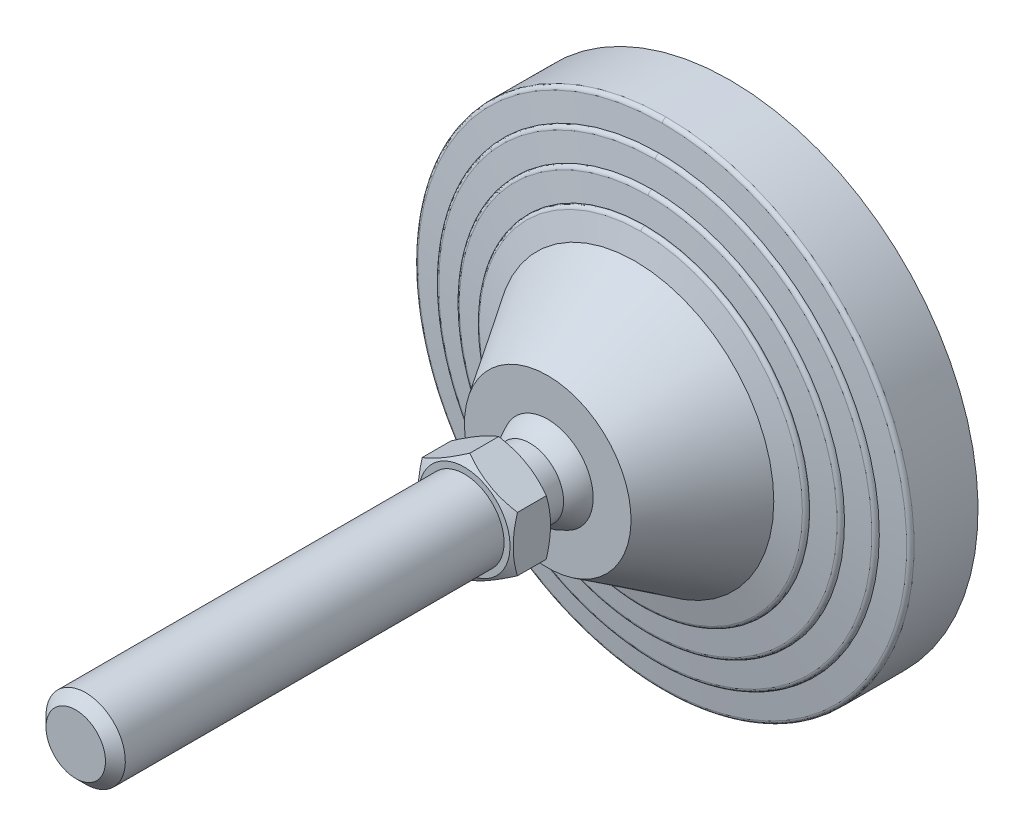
ISO-10303-21;
HEADER;
FILE_DESCRIPTION(('STEP AP214'),'2;1');
FILE_NAME('part.step','',(''),(''),'','','');
FILE_SCHEMA(('AUTOMOTIVE_DESIGN { 1 0 10303 214 1 1 1 1 }'));
ENDSEC;
DATA;
#1=APPLICATION_CONTEXT('core data for automotive mechanical design processes');
#2=APPLICATION_PROTOCOL_DEFINITION('international standard','automotive_design',2000,#1);
#3=PRODUCT_CONTEXT('',#1,'mechanical');
#4=PRODUCT('Part','Part','',(#3));
#5=PRODUCT_RELATED_PRODUCT_CATEGORY('part','',(#4));
#6=PRODUCT_DEFINITION_FORMATION('','',#4);
#7=PRODUCT_DEFINITION_CONTEXT('part definition',#1,'design');
#8=PRODUCT_DEFINITION('design','',#6,#7);
#9=PRODUCT_DEFINITION_SHAPE('','',#8);
#10=(LENGTH_UNIT() NAMED_UNIT(*) SI_UNIT(.MILLI.,.METRE.));
#11=(NAMED_UNIT(*) PLANE_ANGLE_UNIT() SI_UNIT($,.RADIAN.));
#12=(NAMED_UNIT(*) SI_UNIT($,.STERADIAN.) SOLID_ANGLE_UNIT());
#13=UNCERTAINTY_MEASURE_WITH_UNIT(LENGTH_MEASURE(1.E-05),#10,'distance_accuracy_value','');
#14=(GEOMETRIC_REPRESENTATION_CONTEXT(3) GLOBAL_UNCERTAINTY_ASSIGNED_CONTEXT((#13)) GLOBAL_UNIT_ASSIGNED_CONTEXT((#10,
#11,#12)) REPRESENTATION_CONTEXT('',''));
#15=CARTESIAN_POINT('',(0.,0.,0.));
#16=DIRECTION('',(0.,0.,1.));
#17=DIRECTION('',(1.,0.,0.));
#18=AXIS2_PLACEMENT_3D('',#15,#16,#17);
#19=CARTESIAN_POINT('',(-63.467641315,63.25,0.));
#20=DIRECTION('',(0.,0.,1.));
#21=DIRECTION('',(0.,-1.,0.));
#22=AXIS2_PLACEMENT_3D('',#19,#20,#21);
#23=PLANE('',#22);
#24=CARTESIAN_POINT('',(0.,0.,0.));
#25=DIRECTION('',(0.,0.,-1.));
#26=DIRECTION('',(0.,1.,0.));
#27=AXIS2_PLACEMENT_3D('',#24,#25,#26);
#28=CIRCLE('',#27,62.5);
#29=CARTESIAN_POINT('',(0.,62.5,0.));
#30=VERTEX_POINT('',#29);
#31=EDGE_CURVE('E243',#30,#30,#28,.F.);
#32=ORIENTED_EDGE('',*,*,#31,.F.);
#33=EDGE_LOOP('',(#32));
#34=FACE_BOUND('',#33,.T.);
#35=ADVANCED_FACE('F14',(#34),#23,.F.);
#36=CARTESIAN_POINT('',(0.,0.,16.119206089));
#37=DIRECTION('',(0.,0.,-1.));
#38=DIRECTION('',(0.,1.,0.));
#39=AXIS2_PLACEMENT_3D('',#36,#37,#38);
#40=CYLINDRICAL_SURFACE('',#39,62.5);
#41=ORIENTED_EDGE('',*,*,#31,.T.);
#42=EDGE_LOOP('',(#41));
#43=FACE_BOUND('',#42,.T.);
#44=CARTESIAN_POINT('',(0.,0.,16.119206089));
#45=DIRECTION('',(0.,0.,1.));
#46=DIRECTION('',(0.,-1.,0.));
#47=AXIS2_PLACEMENT_3D('',#44,#45,#46);
#48=CIRCLE('',#47,62.5);
#49=CARTESIAN_POINT('',(-6.4094821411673E-09,-62.5,16.119206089));
#50=VERTEX_POINT('',#49);
#51=CARTESIAN_POINT('',(0.,62.5,16.119206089));
#52=VERTEX_POINT('',#51);
#53=EDGE_CURVE('E522',#50,#52,#48,.T.);
#54=ORIENTED_EDGE('',*,*,#53,.F.);
#55=CARTESIAN_POINT('',(0.,0.,16.119206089));
#56=DIRECTION('',(0.,0.,1.));
#57=DIRECTION('',(0.,-1.,0.));
#58=AXIS2_PLACEMENT_3D('',#55,#56,#57);
#59=CIRCLE('',#58,62.5);
#60=EDGE_CURVE('E245',#52,#50,#59,.T.);
#61=ORIENTED_EDGE('',*,*,#60,.F.);
#62=EDGE_LOOP('',(#54,#61));
#63=FACE_BOUND('',#62,.T.);
#64=ADVANCED_FACE('F387',(#43,#63),#40,.T.);
#65=CARTESIAN_POINT('',(0.,-62.5,16.119206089));
#66=CARTESIAN_POINT('',(-125.,-62.5,16.119206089));
#67=CARTESIAN_POINT('',(-125.,62.5,16.119206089));
#68=CARTESIAN_POINT('',(0.,62.5,16.119206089));
#69=CARTESIAN_POINT('',(0.,-62.5,16.647800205));
#70=CARTESIAN_POINT('',(-125.,-62.5000000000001,16.647800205));
#71=CARTESIAN_POINT('',(-125.,62.5000000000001,16.647800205));
#72=CARTESIAN_POINT('',(0.,62.5,16.647800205));
#73=CARTESIAN_POINT('',(0.,-62.1506185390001,17.044466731));
#74=CARTESIAN_POINT('',(-124.301237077,-62.150618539,17.044466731));
#75=CARTESIAN_POINT('',(-124.301237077,62.150618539,17.044466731));
#76=CARTESIAN_POINT('',(0.,62.1506185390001,17.044466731));
#77=CARTESIAN_POINT('',(0.,-61.62625428,17.111204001));
#78=CARTESIAN_POINT('',(-123.252508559,-61.6262542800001,17.111204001));
#79=CARTESIAN_POINT('',(-123.252508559,61.6262542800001,17.111204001));
#80=CARTESIAN_POINT('',(0.,61.62625428,17.111204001));
#81=(BOUNDED_SURFACE() B_SPLINE_SURFACE(3,3,((#65,#66,#67,#68),(#69,#70,#71,#72),(#73,#74,#75,
#76),(#77,#78,#79,#80)),.UNSPECIFIED.,.F.,.F.,.F.) B_SPLINE_SURFACE_WITH_KNOTS((4,4),(4,4),(0.,
1.),(0.,1.),.UNSPECIFIED.) GEOMETRIC_REPRESENTATION_ITEM() RATIONAL_B_SPLINE_SURFACE(((1.,
0.333333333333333,0.333333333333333,1.),(0.833611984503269,0.27787066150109,0.27787066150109,
0.833611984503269),(0.833611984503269,0.27787066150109,0.27787066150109,0.833611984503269),(1.,
0.333333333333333,0.333333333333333,1.))) REPRESENTATION_ITEM('') SURFACE());
#82=CARTESIAN_POINT('',(0.,62.5,16.119206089));
#83=CARTESIAN_POINT('',(0.,62.5,16.647800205));
#84=CARTESIAN_POINT('',(0.,62.1506185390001,17.044466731));
#85=CARTESIAN_POINT('',(0.,61.62625428,17.111204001));
#86=(BOUNDED_CURVE() B_SPLINE_CURVE(3,(#82,#83,#84,#85),.UNSPECIFIED.,.F.,
.F.) B_SPLINE_CURVE_WITH_KNOTS((4,4),(0.,1.),
.UNSPECIFIED.) CURVE() GEOMETRIC_REPRESENTATION_ITEM() RATIONAL_B_SPLINE_CURVE((1.,
0.833611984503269,0.833611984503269,1.)) REPRESENTATION_ITEM(''));
#87=CARTESIAN_POINT('',(0.,61.6262542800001,17.111204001));
#88=VERTEX_POINT('',#87);
#89=EDGE_CURVE('E513',#52,#88,#86,.T.);
#90=CARTESIAN_POINT('',(0.,-62.5,16.119206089));
#91=CARTESIAN_POINT('',(0.,-62.5,16.647800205));
#92=CARTESIAN_POINT('',(0.,-62.1506185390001,17.044466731));
#93=CARTESIAN_POINT('',(0.,-61.62625428,17.111204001));
#94=(BOUNDED_CURVE() B_SPLINE_CURVE(3,(#90,#91,#92,#93),.UNSPECIFIED.,.F.,
.F.) B_SPLINE_CURVE_WITH_KNOTS((4,4),(0.,1.),
.UNSPECIFIED.) CURVE() GEOMETRIC_REPRESENTATION_ITEM() RATIONAL_B_SPLINE_CURVE((1.,
0.833611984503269,0.833611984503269,1.)) REPRESENTATION_ITEM(''));
#95=CARTESIAN_POINT('',(-1.89596340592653E-08,-61.6262542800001,17.111204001));
#96=VERTEX_POINT('',#95);
#97=EDGE_CURVE('E248',#96,#50,#94,.F.);
#98=CARTESIAN_POINT('',(0.,0.,17.111204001));
#99=DIRECTION('',(0.,0.,-1.));
#100=DIRECTION('',(0.,1.,0.));
#101=AXIS2_PLACEMENT_3D('',#98,#99,#100);
#102=CIRCLE('',#101,61.62625428);
#103=EDGE_CURVE('E506',#88,#96,#102,.F.);
#104=ORIENTED_EDGE('',*,*,#89,.F.);
#105=ORIENTED_EDGE('',*,*,#60,.T.);
#106=ORIENTED_EDGE('',*,*,#97,.F.);
#107=ORIENTED_EDGE('',*,*,#103,.F.);
#108=EDGE_LOOP('',(#104,#105,#106,#107));
#109=FACE_BOUND('',#108,.T.);
#110=ADVANCED_FACE('F693',(#109),#81,.T.);
#111=CARTESIAN_POINT('',(0.,62.5,16.119206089));
#112=CARTESIAN_POINT('',(125.,62.5,16.119206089));
#113=CARTESIAN_POINT('',(125.,-62.5,16.119206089));
#114=CARTESIAN_POINT('',(0.,-62.5,16.119206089));
#115=CARTESIAN_POINT('',(0.,62.5,16.647800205));
#116=CARTESIAN_POINT('',(125.,62.5000000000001,16.647800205));
#117=CARTESIAN_POINT('',(125.,-62.5000000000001,16.647800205));
#118=CARTESIAN_POINT('',(0.,-62.5,16.647800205));
#119=CARTESIAN_POINT('',(0.,62.1506185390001,17.044466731));
#120=CARTESIAN_POINT('',(124.301237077,62.150618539,17.044466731));
#121=CARTESIAN_POINT('',(124.301237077,-62.150618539,17.044466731));
#122=CARTESIAN_POINT('',(0.,-62.1506185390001,17.044466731));
#123=CARTESIAN_POINT('',(0.,61.62625428,17.111204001));
#124=CARTESIAN_POINT('',(123.252508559,61.6262542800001,17.111204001));
#125=CARTESIAN_POINT('',(123.252508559,-61.6262542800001,17.111204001));
#126=CARTESIAN_POINT('',(0.,-61.62625428,17.111204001));
#127=(BOUNDED_SURFACE() B_SPLINE_SURFACE(3,3,((#111,#112,#113,#114),(#115,#116,#117,#118),(#119,
#120,#121,#122),(#123,#124,#125,#126)),.UNSPECIFIED.,.F.,.F.,
.F.) B_SPLINE_SURFACE_WITH_KNOTS((4,4),(4,4),(0.,1.),(0.,1.),
.UNSPECIFIED.) GEOMETRIC_REPRESENTATION_ITEM() RATIONAL_B_SPLINE_SURFACE(((1.,0.333333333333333,
0.333333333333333,1.),(0.833611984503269,0.27787066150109,0.27787066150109,0.833611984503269),
(0.833611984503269,0.27787066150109,0.27787066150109,0.833611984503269),(1.,0.333333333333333,
0.333333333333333,1.))) REPRESENTATION_ITEM('') SURFACE());
#128=CARTESIAN_POINT('',(0.,0.,17.111204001));
#129=DIRECTION('',(0.,0.,-1.));
#130=DIRECTION('',(0.,1.,0.));
#131=AXIS2_PLACEMENT_3D('',#128,#129,#130);
#132=CIRCLE('',#131,61.62625428);
#133=EDGE_CURVE('E512',#96,#88,#132,.F.);
#134=ORIENTED_EDGE('',*,*,#53,.T.);
#135=ORIENTED_EDGE('',*,*,#89,.T.);
#136=ORIENTED_EDGE('',*,*,#133,.F.);
#137=ORIENTED_EDGE('',*,*,#97,.T.);
#138=EDGE_LOOP('',(#134,#135,#136,#137));
#139=FACE_BOUND('',#138,.T.);
#140=ADVANCED_FACE('F229',(#139),#127,.T.);
#141=CARTESIAN_POINT('',(0.,0.,17.890909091));
#142=DIRECTION('',(0.,0.,-1.));
#143=DIRECTION('',(0.,1.,0.));
#144=AXIS2_PLACEMENT_3D('',#141,#142,#143);
#145=CONICAL_SURFACE('',#144,55.5,1.44420419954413);
#146=ORIENTED_EDGE('',*,*,#103,.T.);
#147=ORIENTED_EDGE('',*,*,#133,.T.);
#148=EDGE_LOOP('',(#146,#147));
#149=FACE_BOUND('',#148,.T.);
#150=CARTESIAN_POINT('',(-1.13830957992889E-08,-55.5,17.890909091));
#151=CARTESIAN_POINT('',(0.666810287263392,-55.5000058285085,17.890909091));
#152=CARTESIAN_POINT('',(1.33362158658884,-55.4879831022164,17.890909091));
#153=CARTESIAN_POINT('',(2.66828219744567,-55.4398527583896,17.890909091));
#154=CARTESIAN_POINT('',(3.33612903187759,-55.4036764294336,17.890909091));
#155=CARTESIAN_POINT('',(4.67008368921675,-55.3072108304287,17.890909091));
#156=CARTESIAN_POINT('',(5.33619149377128,-55.2469213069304,17.890909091));
#157=CARTESIAN_POINT('',(6.6663069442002,-55.1022519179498,17.890909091));
#158=CARTESIAN_POINT('',(7.33031261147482,-55.0178537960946,17.890909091));
#159=CARTESIAN_POINT('',(8.65488946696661,-54.8250946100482,17.890909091));
#160=CARTESIAN_POINT('',(9.31546019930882,-54.7167304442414,17.890909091));
#161=CARTESIAN_POINT('',(11.3032442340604,-54.3535835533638,17.890909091));
#162=CARTESIAN_POINT('',(12.6239565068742,-54.0621103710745,17.890909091));
#163=CARTESIAN_POINT('',(15.2407929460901,-53.383483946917,17.890909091));
#164=CARTESIAN_POINT('',(16.536910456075,-52.9963051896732,17.890909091));
#165=CARTESIAN_POINT('',(19.0989356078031,-52.1278427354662,17.890909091));
#166=CARTESIAN_POINT('',(20.3648068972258,-51.6464516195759,17.890909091));
#167=CARTESIAN_POINT('',(22.8579438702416,-50.5924539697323,17.890909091));
#168=CARTESIAN_POINT('',(24.0852091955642,-50.0198465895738,17.890909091));
#169=CARTESIAN_POINT('',(26.6786676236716,-48.6922162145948,17.890909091));
#170=CARTESIAN_POINT('',(28.037466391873,-47.9226902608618,17.890909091));
#171=CARTESIAN_POINT('',(30.6855194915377,-46.2718474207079,17.890909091));
#172=CARTESIAN_POINT('',(31.974765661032,-45.3905174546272,17.890909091));
#173=CARTESIAN_POINT('',(34.4745529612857,-43.5222940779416,17.890909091));
#174=CARTESIAN_POINT('',(35.6850872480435,-42.5353915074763,17.890909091));
#175=CARTESIAN_POINT('',(38.0186685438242,-40.4631409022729,17.890909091));
#176=CARTESIAN_POINT('',(39.1417181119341,-39.3777957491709,17.890909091));
#177=CARTESIAN_POINT('',(41.292347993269,-37.1163936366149,17.890909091));
#178=CARTESIAN_POINT('',(42.3199319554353,-35.9403401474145,17.890909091));
#179=CARTESIAN_POINT('',(44.2723789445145,-33.5058382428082,17.890909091));
#180=CARTESIAN_POINT('',(45.1972412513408,-32.2473892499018,17.890909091));
#181=CARTESIAN_POINT('',(46.937631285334,-29.6570957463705,17.890909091));
#182=CARTESIAN_POINT('',(47.7531628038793,-28.3252537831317,17.890909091));
#183=CARTESIAN_POINT('',(49.2691299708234,-25.5976050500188,17.890909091));
#184=CARTESIAN_POINT('',(49.9695658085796,-24.2017983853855,17.890909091));
#185=CARTESIAN_POINT('',(51.2503706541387,-21.3561258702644,17.890909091));
#186=CARTESIAN_POINT('',(51.8307383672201,-19.9062594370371,17.890909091));
#187=CARTESIAN_POINT('',(52.8672716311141,-16.9627885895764,17.890909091));
#188=CARTESIAN_POINT('',(53.3234371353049,-15.4691841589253,17.890909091));
#189=CARTESIAN_POINT('',(54.1083272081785,-12.448838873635,17.890909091));
#190=CARTESIAN_POINT('',(54.4370503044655,-10.9220976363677,17.890909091));
#191=CARTESIAN_POINT('',(54.9647110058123,-7.84634988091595,17.890909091));
#192=CARTESIAN_POINT('',(55.1636486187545,-6.29734336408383,17.890909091));
#193=CARTESIAN_POINT('',(55.4303245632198,-3.1880715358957,17.890909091));
#194=CARTESIAN_POINT('',(55.4980623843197,-1.62780618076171,17.890909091));
#195=CARTESIAN_POINT('',(55.5018556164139,1.49288460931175,17.890909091));
#196=CARTESIAN_POINT('',(55.437911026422,3.05331004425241,17.890909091));
#197=CARTESIAN_POINT('',(55.1787965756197,6.16319684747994,17.890909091));
#198=CARTESIAN_POINT('',(54.9836292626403,7.71265842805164,17.890909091));
#199=CARTESIAN_POINT('',(54.4634594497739,10.7896325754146,17.890909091));
#200=CARTESIAN_POINT('',(54.1384569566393,12.3171451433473,17.890909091));
#201=CARTESIAN_POINT('',(53.3609336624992,15.3393372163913,17.890909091));
#202=CARTESIAN_POINT('',(52.9084149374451,16.8340172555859,17.890909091));
#203=CARTESIAN_POINT('',(51.8790738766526,19.7799443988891,17.890909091));
#204=CARTESIAN_POINT('',(51.3022515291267,21.231191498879,17.890909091));
#205=CARTESIAN_POINT('',(50.0283709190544,24.0800097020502,17.890909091));
#206=CARTESIAN_POINT('',(49.3313064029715,25.4775780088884,17.890909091));
#207=CARTESIAN_POINT('',(47.8219174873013,28.2090226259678,17.890909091));
#208=CARTESIAN_POINT('',(47.0095931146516,29.5428989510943,17.890909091));
#209=CARTESIAN_POINT('',(45.2754391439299,32.1375097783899,17.890909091));
#210=CARTESIAN_POINT('',(44.3536065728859,33.3982422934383,17.890909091));
#211=CARTESIAN_POINT('',(42.4069961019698,35.8375708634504,17.890909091));
#212=CARTESIAN_POINT('',(41.3822180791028,37.0161668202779,17.890909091));
#213=CARTESIAN_POINT('',(39.2371577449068,39.2826945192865,17.890909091));
#214=CARTESIAN_POINT('',(38.1168855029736,40.370635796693,17.890909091));
#215=CARTESIAN_POINT('',(35.7885615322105,42.4483529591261,17.890909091));
#216=CARTESIAN_POINT('',(34.5805102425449,43.4381293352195,17.890909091));
#217=CARTESIAN_POINT('',(32.5014047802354,44.9999063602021,17.890909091));
#218=CARTESIAN_POINT('',(31.6521856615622,45.6012216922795,17.890909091));
#219=CARTESIAN_POINT('',(29.9212415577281,46.7552239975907,17.890909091));
#220=CARTESIAN_POINT('',(29.0395163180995,47.3079105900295,17.890909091));
#221=CARTESIAN_POINT('',(27.246397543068,48.3628576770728,17.890909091));
#222=CARTESIAN_POINT('',(26.3350034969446,48.8651173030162,17.890909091));
#223=CARTESIAN_POINT('',(24.4853750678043,49.8176528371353,17.890909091));
#224=CARTESIAN_POINT('',(23.5471392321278,50.2679259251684,17.890909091));
#225=CARTESIAN_POINT('',(21.6468644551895,51.1150215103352,17.890909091));
#226=CARTESIAN_POINT('',(20.6848259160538,51.5118449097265,17.890909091));
#227=CARTESIAN_POINT('',(18.7400290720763,52.250772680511,17.890909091));
#228=CARTESIAN_POINT('',(17.7572723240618,52.5928811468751,17.890909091));
#229=CARTESIAN_POINT('',(15.863617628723,53.1929617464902,17.890909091));
#230=CARTESIAN_POINT('',(14.9542390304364,53.4557406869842,17.890909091));
#231=CARTESIAN_POINT('',(13.123285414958,53.9344479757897,17.890909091));
#232=CARTESIAN_POINT('',(12.2017111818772,54.1503793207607,17.890909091));
#233=CARTESIAN_POINT('',(10.3487557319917,54.5348378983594,17.890909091));
#234=CARTESIAN_POINT('',(9.41737477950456,54.7033664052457,17.890909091));
#235=CARTESIAN_POINT('',(7.54728204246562,54.9925789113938,17.890909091));
#236=CARTESIAN_POINT('',(6.60857079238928,55.1132663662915,17.890909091));
#237=CARTESIAN_POINT('',(4.72616569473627,55.3064952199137,17.890909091));
#238=CARTESIAN_POINT('',(3.78247163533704,55.3790345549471,17.890909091));
#239=CARTESIAN_POINT('',(1.89251924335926,55.4758006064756,17.890909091));
#240=CARTESIAN_POINT('',(0.946260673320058,55.5000226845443,17.890909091));
#241=CARTESIAN_POINT('',(-1.6611636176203E-09,55.5,17.890909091));
#242=B_SPLINE_CURVE_WITH_KNOTS('',3,(#150,#151,#152,#153,#154,#155,#156,#157,#158,#159,#160,
#161,#162,#163,#164,#165,#166,#167,#168,#169,#170,#171,#172,#173,#174,#175,#176,#177,#178,#179,
#180,#181,#182,#183,#184,#185,#186,#187,#188,#189,#190,#191,#192,#193,#194,#195,#196,#197,#198,
#199,#200,#201,#202,#203,#204,#205,#206,#207,#208,#209,#210,#211,#212,#213,#214,#215,#216,#217,
#218,#219,#220,#221,#222,#223,#224,#225,#226,#227,#228,#229,#230,#231,#232,#233,#234,#235,#236,
#237,#238,#239,#240,#241),.UNSPECIFIED.,.F.,.F.,(4,2,2,2,2,2,2,2,2,2,2,2,2,2,2,2,2,2,2,2,2,2,2,
2,2,2,2,2,2,2,2,2,2,2,2,2,2,2,2,2,2,2,2,2,2,4),(0.,2.00032482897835,4.00636450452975,
6.01242526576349,8.02000917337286,10.0278530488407,14.0813911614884,18.1360111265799,
22.1952813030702,26.2545891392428,30.9336173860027,35.6131935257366,40.2931760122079,
44.9730215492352,49.6526881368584,54.332387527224,59.0119245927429,63.6914539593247,
68.3710337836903,73.0506153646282,77.730251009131,82.4098863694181,87.0895399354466,
91.7691935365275,96.4487562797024,101.128318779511,105.807805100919,110.487291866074,
115.167022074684,119.846751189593,124.526607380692,129.206469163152,133.885838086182,
138.565183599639,141.685351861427,144.805544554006,147.925790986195,151.046206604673,
154.16656954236,157.286698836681,160.12523673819,162.963593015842,165.801872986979,
168.639947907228,171.478144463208,174.316613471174),.UNSPECIFIED.);
#243=CARTESIAN_POINT('',(-1.13832320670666E-08,-55.5,17.895966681));
#244=VERTEX_POINT('',#243);
#245=CARTESIAN_POINT('',(-1.6611821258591E-09,55.5,17.895966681));
#246=VERTEX_POINT('',#245);
#247=EDGE_CURVE('E210',#244,#246,#242,.T.);
#248=ORIENTED_EDGE('',*,*,#247,.F.);
#249=CARTESIAN_POINT('',(-1.66117986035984E-09,55.5,17.890909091));
#250=CARTESIAN_POINT('',(-0.66681030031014,55.5000058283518,17.890909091));
#251=CARTESIAN_POINT('',(-1.33362159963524,55.4879831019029,17.890909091));
#252=CARTESIAN_POINT('',(-2.66828221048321,55.4398527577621,17.890909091));
#253=CARTESIAN_POINT('',(-3.33612904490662,55.403676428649,17.890909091));
#254=CARTESIAN_POINT('',(-4.6700837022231,55.3072108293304,17.890909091));
#255=CARTESIAN_POINT('',(-5.33619150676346,55.2469213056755,17.890909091));
#256=CARTESIAN_POINT('',(-6.66630695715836,55.1022519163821,17.890909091));
#257=CARTESIAN_POINT('',(-7.33031262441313,55.0178537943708,17.890909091));
#258=CARTESIAN_POINT('',(-8.6548894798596,54.8250946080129,17.890909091));
#259=CARTESIAN_POINT('',(-9.31546021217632,54.7167304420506,17.890909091));
#260=CARTESIAN_POINT('',(-11.3032442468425,54.3535835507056,17.890909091));
#261=CARTESIAN_POINT('',(-12.6239565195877,54.0621103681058,17.890909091));
#262=CARTESIAN_POINT('',(-15.2407929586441,53.3834839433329,17.890909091));
#263=CARTESIAN_POINT('',(-16.5369104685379,52.9963051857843,17.890909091));
#264=CARTESIAN_POINT('',(-19.0989356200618,52.1278427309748,17.890909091));
#265=CARTESIAN_POINT('',(-20.3648069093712,51.6464516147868,17.890909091));
#266=CARTESIAN_POINT('',(-22.8579438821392,50.5924539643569,17.890909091));
#267=CARTESIAN_POINT('',(-24.0852092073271,50.0198465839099,17.890909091));
#268=CARTESIAN_POINT('',(-26.6786676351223,48.6922162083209,17.890909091));
#269=CARTESIAN_POINT('',(-28.0374664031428,47.9226902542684,17.890909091));
#270=CARTESIAN_POINT('',(-30.6855195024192,46.2718474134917,17.890909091));
#271=CARTESIAN_POINT('',(-31.9747656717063,45.3905174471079,17.890909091));
#272=CARTESIAN_POINT('',(-34.4745529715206,43.5222940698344,17.890909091));
#273=CARTESIAN_POINT('',(-35.6850872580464,42.5353914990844,17.890909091));
#274=CARTESIAN_POINT('',(-38.0186685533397,40.4631408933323,17.890909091));
#275=CARTESIAN_POINT('',(-39.1417181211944,39.3777957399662,17.890909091));
#276=CARTESIAN_POINT('',(-41.2923480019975,37.1163936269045,17.890909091));
#277=CARTESIAN_POINT('',(-42.3199319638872,35.9403401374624,17.890909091));
#278=CARTESIAN_POINT('',(-44.2723789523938,33.5058382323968,17.890909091));
#279=CARTESIAN_POINT('',(-45.1972412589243,32.247389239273,17.890909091));
#280=CARTESIAN_POINT('',(-46.9376312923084,29.6570957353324,17.890909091));
#281=CARTESIAN_POINT('',(-47.7531628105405,28.3252537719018,17.890909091));
#282=CARTESIAN_POINT('',(-49.2691299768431,25.5976050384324,17.890909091));
#283=CARTESIAN_POINT('',(-49.9695658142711,24.2017983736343,17.890909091));
#284=CARTESIAN_POINT('',(-51.250370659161,21.3561258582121,17.890909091));
#285=CARTESIAN_POINT('',(-51.8307383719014,19.9062594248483,17.890909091));
#286=CARTESIAN_POINT('',(-52.8672716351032,16.9627885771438,17.890909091));
#287=CARTESIAN_POINT('',(-53.3234371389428,15.4691841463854,17.890909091));
#288=CARTESIAN_POINT('',(-54.1083272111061,12.4488388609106,17.890909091));
#289=CARTESIAN_POINT('',(-54.437050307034,10.9220976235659,17.890909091));
#290=CARTESIAN_POINT('',(-54.9647110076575,7.8463498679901,17.890909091));
#291=CARTESIAN_POINT('',(-55.1636486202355,6.29734335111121,17.890909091));
#292=CARTESIAN_POINT('',(-55.4303245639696,3.18807152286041,17.890909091));
#293=CARTESIAN_POINT('',(-55.4980623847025,1.6278061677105,17.890909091));
#294=CARTESIAN_POINT('',(-55.5018556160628,-1.49288462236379,17.890909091));
#295=CARTESIAN_POINT('',(-55.4379110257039,-3.05331005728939,17.890909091));
#296=CARTESIAN_POINT('',(-55.1787965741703,-6.16319686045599,17.890909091));
#297=CARTESIAN_POINT('',(-54.9836292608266,-7.71265844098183,17.890909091));
#298=CARTESIAN_POINT('',(-54.4634594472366,-10.7896325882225,17.890909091));
#299=CARTESIAN_POINT('',(-54.1384569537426,-12.3171451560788,17.890909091));
#300=CARTESIAN_POINT('',(-53.3609336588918,-15.3393372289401,17.890909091));
#301=CARTESIAN_POINT('',(-52.9084149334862,-16.8340172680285,17.890909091));
#302=CARTESIAN_POINT('',(-51.8790738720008,-19.7799444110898,17.890909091));
#303=CARTESIAN_POINT('',(-51.3022515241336,-21.2311915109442,17.890909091));
#304=CARTESIAN_POINT('',(-50.0283709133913,-24.0800097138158,17.890909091));
#305=CARTESIAN_POINT('',(-49.3313063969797,-25.47757802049,17.890909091));
#306=CARTESIAN_POINT('',(-47.8219174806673,-28.2090226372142,17.890909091));
#307=CARTESIAN_POINT('',(-47.009593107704,-29.5428989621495,17.890909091));
#308=CARTESIAN_POINT('',(-45.2754391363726,-32.1375097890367,17.890909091));
#309=CARTESIAN_POINT('',(-44.3536065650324,-33.3982423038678,17.890909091));
#310=CARTESIAN_POINT('',(-42.4069960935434,-35.8375708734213,17.890909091));
#311=CARTESIAN_POINT('',(-41.3822180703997,-37.0161668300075,17.890909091));
#312=CARTESIAN_POINT('',(-39.2371577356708,-39.2826945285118,17.890909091));
#313=CARTESIAN_POINT('',(-38.1168854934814,-40.3706358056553,17.890909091));
#314=CARTESIAN_POINT('',(-35.7885615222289,-42.4483529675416,17.890909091));
#315=CARTESIAN_POINT('',(-34.5805102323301,-43.4381293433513,17.890909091));
#316=CARTESIAN_POINT('',(-32.5014047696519,-44.9999063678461,17.890909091));
#317=CARTESIAN_POINT('',(-31.6521856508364,-45.6012216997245,17.890909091));
#318=CARTESIAN_POINT('',(-29.9212415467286,-46.7552240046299,17.890909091));
#319=CARTESIAN_POINT('',(-29.0395163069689,-47.307910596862,17.890909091));
#320=CARTESIAN_POINT('',(-27.2463975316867,-48.3628576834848,17.890909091));
#321=CARTESIAN_POINT('',(-26.3350034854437,-48.8651173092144,17.890909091));
#322=CARTESIAN_POINT('',(-24.4853750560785,-49.8176528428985,17.890909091));
#323=CARTESIAN_POINT('',(-23.5471392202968,-50.2679259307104,17.890909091));
#324=CARTESIAN_POINT('',(-21.646864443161,-51.1150215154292,17.890909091));
#325=CARTESIAN_POINT('',(-20.684825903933,-51.5118449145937,17.890909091));
#326=CARTESIAN_POINT('',(-18.7400290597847,-52.2507726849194,17.890909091));
#327=CARTESIAN_POINT('',(-17.7572723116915,-52.5928811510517,17.890909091));
#328=CARTESIAN_POINT('',(-15.8636176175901,-53.1929617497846,17.890909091));
#329=CARTESIAN_POINT('',(-14.9542390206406,-53.4557406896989,17.890909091));
#330=CARTESIAN_POINT('',(-13.1232854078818,-53.9344479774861,17.890909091));
#331=CARTESIAN_POINT('',(-12.2017111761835,-54.1503793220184,17.890909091));
#332=CARTESIAN_POINT('',(-10.3487557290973,-54.5348378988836,17.890909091));
#333=CARTESIAN_POINT('',(-9.41737477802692,-54.7033664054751,17.890909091));
#334=CARTESIAN_POINT('',(-7.54728204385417,-54.9925789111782,17.890909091));
#335=CARTESIAN_POINT('',(-6.60857079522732,-55.1132663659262,17.890909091));
#336=CARTESIAN_POINT('',(-4.72616570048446,-55.3064952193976,17.890909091));
#337=CARTESIAN_POINT('',(-3.78247164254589,-55.3790345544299,17.890909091));
#338=CARTESIAN_POINT('',(-1.89251925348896,-55.4758006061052,17.890909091));
#339=CARTESIAN_POINT('',(-0.946260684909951,-55.5000226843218,17.890909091));
#340=CARTESIAN_POINT('',(-1.13832331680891E-08,-55.5,17.890909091));
#341=B_SPLINE_CURVE_WITH_KNOTS('',3,(#249,#250,#251,#252,#253,#254,#255,#256,#257,#258,#259,
#260,#261,#262,#263,#264,#265,#266,#267,#268,#269,#270,#271,#272,#273,#274,#275,#276,#277,#278,
#279,#280,#281,#282,#283,#284,#285,#286,#287,#288,#289,#290,#291,#292,#293,#294,#295,#296,#297,
#298,#299,#300,#301,#302,#303,#304,#305,#306,#307,#308,#309,#310,#311,#312,#313,#314,#315,#316,
#317,#318,#319,#320,#321,#322,#323,#324,#325,#326,#327,#328,#329,#330,#331,#332,#333,#334,#335,
#336,#337,#338,#339,#340),.UNSPECIFIED.,.F.,.F.,(4,2,2,2,2,2,2,2,2,2,2,2,2,2,2,2,2,2,2,2,2,2,2,
2,2,2,2,2,2,2,2,2,2,2,2,2,2,2,2,2,2,2,2,2,2,4),(0.,2.00032482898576,4.00636450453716,
6.01242526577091,8.02000917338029,10.0278530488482,14.0813911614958,18.1360111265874,
22.1952813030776,26.2545891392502,30.93361738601,35.613193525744,40.2931760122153,
44.9730215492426,49.6526881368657,54.3323875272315,59.0119245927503,63.6914539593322,
68.3710337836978,73.0506153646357,77.7302510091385,82.4098863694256,87.089539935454,
91.7691935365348,96.4487562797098,101.128318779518,105.807805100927,110.487291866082,
115.167022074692,119.846751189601,124.526607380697,129.206469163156,133.885838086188,
138.565183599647,141.685351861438,144.805544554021,147.925790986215,151.04620660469,
154.166569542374,157.286698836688,160.125236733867,162.963593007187,165.801872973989,
168.639947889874,171.47814444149,174.316613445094),.UNSPECIFIED.);
#342=EDGE_CURVE('E222',#246,#244,#341,.T.);
#343=ORIENTED_EDGE('',*,*,#342,.F.);
#344=EDGE_LOOP('',(#248,#343));
#345=FACE_BOUND('',#344,.T.);
#346=ADVANCED_FACE('F224',(#149,#345),#145,.T.);
#347=CARTESIAN_POINT('',(0.,-55.5,17.887804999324));
#348=CARTESIAN_POINT('',(-111.,-55.5000000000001,17.8878049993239));
#349=CARTESIAN_POINT('',(-111.,55.5000000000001,17.8878049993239));
#350=CARTESIAN_POINT('',(0.,55.5,17.887804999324));
#351=CARTESIAN_POINT('',(0.,-55.5,17.892211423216));
#352=CARTESIAN_POINT('',(-111.,-55.5000000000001,17.892211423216));
#353=CARTESIAN_POINT('',(-111.,55.5000000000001,17.892211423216));
#354=CARTESIAN_POINT('',(0.,55.5,17.892211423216));
#355=CARTESIAN_POINT('',(0.,-55.5,17.896617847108));
#356=CARTESIAN_POINT('',(-111.,-55.5000000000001,17.896617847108));
#357=CARTESIAN_POINT('',(-111.,55.5000000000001,17.896617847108));
#358=CARTESIAN_POINT('',(0.,55.5,17.896617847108));
#359=CARTESIAN_POINT('',(0.,-55.5,17.901024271));
#360=CARTESIAN_POINT('',(-111.,-55.5000000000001,17.901024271));
#361=CARTESIAN_POINT('',(-111.,55.5000000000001,17.901024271));
#362=CARTESIAN_POINT('',(0.,55.5,17.901024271));
#363=CARTESIAN_POINT('',(0.,-55.5,18.429618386));
#364=CARTESIAN_POINT('',(-111.,-55.5000000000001,18.429618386));
#365=CARTESIAN_POINT('',(-111.,55.5000000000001,18.429618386));
#366=CARTESIAN_POINT('',(0.,55.5,18.429618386));
#367=CARTESIAN_POINT('',(0.,-55.150618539,18.826284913));
#368=CARTESIAN_POINT('',(-110.301237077,-55.1506185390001,18.826284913));
#369=CARTESIAN_POINT('',(-110.301237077,55.1506185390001,18.826284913));
#370=CARTESIAN_POINT('',(0.,55.150618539,18.826284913));
#371=CARTESIAN_POINT('',(0.,-54.62625428,18.893022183));
#372=CARTESIAN_POINT('',(-109.252508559,-54.62625428,18.893022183));
#373=CARTESIAN_POINT('',(-109.252508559,54.62625428,18.893022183));
#374=CARTESIAN_POINT('',(0.,54.62625428,18.893022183));
#375=(BOUNDED_SURFACE() B_SPLINE_SURFACE(3,3,((#347,#348,#349,#350),(#351,#352,#353,#354),(#355,
#356,#357,#358),(#359,#360,#361,#362),(#363,#364,#365,#366),(#367,#368,#369,#370),(#371,#372,
#373,#374)),.UNSPECIFIED.,.F.,.F.,.F.) B_SPLINE_SURFACE_WITH_KNOTS((4,3,4),(4,4),(-0.01,0.,1.),
(0.,1.),.UNSPECIFIED.) GEOMETRIC_REPRESENTATION_ITEM() RATIONAL_B_SPLINE_SURFACE(((1.,
0.333333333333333,0.333333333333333,1.),(1.,0.333333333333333,0.333333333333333,1.),(1.,
0.333333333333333,0.333333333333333,1.),(1.,0.333333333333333,0.333333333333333,1.),
(0.833611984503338,0.277870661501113,0.277870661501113,0.833611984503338),(0.833611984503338,
0.277870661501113,0.277870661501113,0.833611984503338),(1.,0.333333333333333,0.333333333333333,1.))) REPRESENTATION_ITEM('') SURFACE());
#376=CARTESIAN_POINT('',(0.,55.5,17.901024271));
#377=CARTESIAN_POINT('',(0.,55.5,18.429618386));
#378=CARTESIAN_POINT('',(0.,55.150618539,18.826284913));
#379=CARTESIAN_POINT('',(0.,54.62625428,18.893022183));
#380=(BOUNDED_CURVE() B_SPLINE_CURVE(3,(#376,#377,#378,#379),.UNSPECIFIED.,.F.,
.F.) B_SPLINE_CURVE_WITH_KNOTS((4,4),(0.,1.),
.UNSPECIFIED.) CURVE() GEOMETRIC_REPRESENTATION_ITEM() RATIONAL_B_SPLINE_CURVE((1.,
0.833611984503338,0.833611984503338,1.)) REPRESENTATION_ITEM(''));
#381=CARTESIAN_POINT('',(0.,54.6262542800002,18.8930221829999));
#382=VERTEX_POINT('',#381);
#383=EDGE_CURVE('E213',#246,#382,#380,.T.);
#384=CARTESIAN_POINT('',(0.,-55.5,17.901024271));
#385=CARTESIAN_POINT('',(0.,-55.5,18.429618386));
#386=CARTESIAN_POINT('',(0.,-55.150618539,18.826284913));
#387=CARTESIAN_POINT('',(0.,-54.62625428,18.893022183));
#388=(BOUNDED_CURVE() B_SPLINE_CURVE(3,(#384,#385,#386,#387),.UNSPECIFIED.,.F.,
.F.) B_SPLINE_CURVE_WITH_KNOTS((4,4),(0.,1.),
.UNSPECIFIED.) CURVE() GEOMETRIC_REPRESENTATION_ITEM() RATIONAL_B_SPLINE_CURVE((1.,
0.833611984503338,0.833611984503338,1.)) REPRESENTATION_ITEM(''));
#389=CARTESIAN_POINT('',(-1.68060480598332E-08,-54.6262542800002,18.8930221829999));
#390=VERTEX_POINT('',#389);
#391=EDGE_CURVE('E214',#390,#244,#388,.F.);
#392=CARTESIAN_POINT('',(0.,0.,18.8930221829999));
#393=DIRECTION('',(0.,0.,-1.));
#394=DIRECTION('',(0.,1.,0.));
#395=AXIS2_PLACEMENT_3D('',#392,#393,#394);
#396=CIRCLE('',#395,54.62625428);
#397=EDGE_CURVE('E478',#382,#390,#396,.F.);
#398=ORIENTED_EDGE('',*,*,#383,.F.);
#399=ORIENTED_EDGE('',*,*,#342,.T.);
#400=ORIENTED_EDGE('',*,*,#391,.F.);
#401=ORIENTED_EDGE('',*,*,#397,.F.);
#402=EDGE_LOOP('',(#398,#399,#400,#401));
#403=FACE_BOUND('',#402,.T.);
#404=ADVANCED_FACE('F228',(#403),#375,.T.);
#405=CARTESIAN_POINT('',(0.,55.5,17.887804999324));
#406=CARTESIAN_POINT('',(111.,55.5000000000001,17.8878049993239));
#407=CARTESIAN_POINT('',(111.,-55.5000000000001,17.8878049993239));
#408=CARTESIAN_POINT('',(0.,-55.5,17.887804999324));
#409=CARTESIAN_POINT('',(0.,55.5,17.892211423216));
#410=CARTESIAN_POINT('',(111.,55.5000000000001,17.892211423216));
#411=CARTESIAN_POINT('',(111.,-55.5000000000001,17.892211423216));
#412=CARTESIAN_POINT('',(0.,-55.5,17.892211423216));
#413=CARTESIAN_POINT('',(0.,55.5,17.896617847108));
#414=CARTESIAN_POINT('',(111.,55.5000000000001,17.896617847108));
#415=CARTESIAN_POINT('',(111.,-55.5000000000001,17.896617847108));
#416=CARTESIAN_POINT('',(0.,-55.5,17.896617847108));
#417=CARTESIAN_POINT('',(0.,55.5,17.901024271));
#418=CARTESIAN_POINT('',(111.,55.5000000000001,17.901024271));
#419=CARTESIAN_POINT('',(111.,-55.5000000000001,17.901024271));
#420=CARTESIAN_POINT('',(0.,-55.5,17.901024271));
#421=CARTESIAN_POINT('',(0.,55.5,18.429618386));
#422=CARTESIAN_POINT('',(111.,55.5000000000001,18.429618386));
#423=CARTESIAN_POINT('',(111.,-55.5000000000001,18.429618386));
#424=CARTESIAN_POINT('',(0.,-55.5,18.429618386));
#425=CARTESIAN_POINT('',(0.,55.150618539,18.826284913));
#426=CARTESIAN_POINT('',(110.301237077,55.1506185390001,18.826284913));
#427=CARTESIAN_POINT('',(110.301237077,-55.1506185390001,18.826284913));
#428=CARTESIAN_POINT('',(0.,-55.150618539,18.826284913));
#429=CARTESIAN_POINT('',(0.,54.62625428,18.893022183));
#430=CARTESIAN_POINT('',(109.252508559,54.62625428,18.893022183));
#431=CARTESIAN_POINT('',(109.252508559,-54.62625428,18.893022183));
#432=CARTESIAN_POINT('',(0.,-54.62625428,18.893022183));
#433=(BOUNDED_SURFACE() B_SPLINE_SURFACE(3,3,((#405,#406,#407,#408),(#409,#410,#411,#412),(#413,
#414,#415,#416),(#417,#418,#419,#420),(#421,#422,#423,#424),(#425,#426,#427,#428),(#429,#430,
#431,#432)),.UNSPECIFIED.,.F.,.F.,.F.) B_SPLINE_SURFACE_WITH_KNOTS((4,3,4),(4,4),(-0.01,0.,1.),
(0.,1.),.UNSPECIFIED.) GEOMETRIC_REPRESENTATION_ITEM() RATIONAL_B_SPLINE_SURFACE(((1.,
0.333333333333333,0.333333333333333,1.),(1.,0.333333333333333,0.333333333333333,1.),(1.,
0.333333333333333,0.333333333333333,1.),(1.,0.333333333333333,0.333333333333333,1.),
(0.833611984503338,0.277870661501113,0.277870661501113,0.833611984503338),(0.833611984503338,
0.277870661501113,0.277870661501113,0.833611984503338),(1.,0.333333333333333,0.333333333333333,1.))) REPRESENTATION_ITEM('') SURFACE());
#434=CARTESIAN_POINT('',(0.,0.,18.8930221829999));
#435=DIRECTION('',(0.,0.,-1.));
#436=DIRECTION('',(0.,1.,0.));
#437=AXIS2_PLACEMENT_3D('',#434,#435,#436);
#438=CIRCLE('',#437,54.62625428);
#439=EDGE_CURVE('E484',#390,#382,#438,.F.);
#440=ORIENTED_EDGE('',*,*,#247,.T.);
#441=ORIENTED_EDGE('',*,*,#383,.T.);
#442=ORIENTED_EDGE('',*,*,#439,.F.);
#443=ORIENTED_EDGE('',*,*,#391,.T.);
#444=EDGE_LOOP('',(#440,#441,#442,#443));
#445=FACE_BOUND('',#444,.T.);
#446=ADVANCED_FACE('F194',(#445),#433,.T.);
#447=CARTESIAN_POINT('',(0.,0.,19.672727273));
#448=DIRECTION('',(0.,0.,-1.));
#449=DIRECTION('',(0.,1.,0.));
#450=AXIS2_PLACEMENT_3D('',#447,#448,#449);
#451=CONICAL_SURFACE('',#450,48.5,1.44420419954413);
#452=ORIENTED_EDGE('',*,*,#397,.T.);
#453=ORIENTED_EDGE('',*,*,#439,.T.);
#454=EDGE_LOOP('',(#452,#453));
#455=FACE_BOUND('',#454,.T.);
#456=CARTESIAN_POINT('',(-9.9473684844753E-09,-48.5,19.672727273));
#457=CARTESIAN_POINT('',(0.333415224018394,-48.4999999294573,19.672727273));
#458=CARTESIAN_POINT('',(0.666820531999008,-48.4965617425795,19.672727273));
#459=CARTESIAN_POINT('',(1.3335278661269,-48.4828103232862,19.672727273));
#460=CARTESIAN_POINT('',(1.66682987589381,-48.4724962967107,19.672727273));
#461=CARTESIAN_POINT('',(2.66872204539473,-48.4311451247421,19.672727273));
#462=CARTESIAN_POINT('',(3.33691272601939,-48.3896987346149,19.672727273));
#463=CARTESIAN_POINT('',(4.6710427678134,-48.2791827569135,19.672727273));
#464=CARTESIAN_POINT('',(5.33698191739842,-48.2101106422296,19.672727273));
#465=CARTESIAN_POINT('',(6.66612914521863,-48.0443714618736,19.672727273));
#466=CARTESIAN_POINT('',(7.32933372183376,-47.9476761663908,19.672727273));
#467=CARTESIAN_POINT('',(8.65121670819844,-47.726886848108,19.672727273));
#468=CARTESIAN_POINT('',(9.30989445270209,-47.6027888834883,19.672727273));
#469=CARTESIAN_POINT('',(11.2942742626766,-47.1861322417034,19.672727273));
#470=CARTESIAN_POINT('',(12.6113745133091,-46.851316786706,19.672727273));
#471=CARTESIAN_POINT('',(15.2131663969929,-46.0722804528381,19.672727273));
#472=CARTESIAN_POINT('',(16.4978453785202,-45.6280175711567,19.672727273));
#473=CARTESIAN_POINT('',(19.0268967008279,-44.6326754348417,19.672727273));
#474=CARTESIAN_POINT('',(20.2712210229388,-44.0814740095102,19.672727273));
#475=CARTESIAN_POINT('',(22.7090353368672,-42.8765478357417,19.672727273));
#476=CARTESIAN_POINT('',(23.90253015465,-42.2228328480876,19.672727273));
#477=CARTESIAN_POINT('',(26.233906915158,-40.8153372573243,19.672727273));
#478=CARTESIAN_POINT('',(27.3716102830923,-40.0612608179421,19.672727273));
#479=CARTESIAN_POINT('',(29.5794657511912,-38.4599142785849,19.672727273));
#480=CARTESIAN_POINT('',(30.6496160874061,-37.6126417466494,19.672727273));
#481=CARTESIAN_POINT('',(32.7144313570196,-35.8311972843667,19.672727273));
#482=CARTESIAN_POINT('',(33.7091176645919,-34.8970501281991,19.672727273));
#483=CARTESIAN_POINT('',(35.6162650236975,-32.9482983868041,19.672727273));
#484=CARTESIAN_POINT('',(36.5287266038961,-31.9336943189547,19.672727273));
#485=CARTESIAN_POINT('',(38.2650470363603,-29.8311130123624,19.672727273));
#486=CARTESIAN_POINT('',(39.0888956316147,-28.7431273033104,19.672727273));
#487=CARTESIAN_POINT('',(40.6420135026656,-26.5016202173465,19.672727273));
#488=CARTESIAN_POINT('',(41.3712826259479,-25.348098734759,19.672727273));
#489=CARTESIAN_POINT('',(42.7300878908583,-22.9836659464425,19.672727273));
#490=CARTESIAN_POINT('',(43.3596192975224,-21.7727519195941,19.672727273));
#491=CARTESIAN_POINT('',(44.5144313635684,-19.3021944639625,19.672727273));
#492=CARTESIAN_POINT('',(45.0397120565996,-18.042551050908,19.672727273));
#493=CARTESIAN_POINT('',(45.9822772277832,-15.4835203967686,19.672727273));
#494=CARTESIAN_POINT('',(46.3995642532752,-14.1841340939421,19.672727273));
#495=CARTESIAN_POINT('',(47.1231916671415,-11.554827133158,19.672727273));
#496=CARTESIAN_POINT('',(47.4295320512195,-10.224906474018,19.672727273));
#497=CARTESIAN_POINT('',(47.9290880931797,-7.54398668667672,19.672727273));
#498=CARTESIAN_POINT('',(48.1223038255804,-6.19298757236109,19.672727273));
#499=CARTESIAN_POINT('',(48.3942372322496,-3.47951480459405,19.672727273));
#500=CARTESIAN_POINT('',(48.4729549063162,-2.11704115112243,19.672727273));
#501=CARTESIAN_POINT('',(48.5153327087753,0.609703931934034,19.672727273));
#502=CARTESIAN_POINT('',(48.4789920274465,1.97397537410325,19.672727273));
#503=CARTESIAN_POINT('',(48.2915097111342,4.69460717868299,19.672727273));
#504=CARTESIAN_POINT('',(48.1403680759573,6.05096754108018,19.672727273));
#505=CARTESIAN_POINT('',(47.7243611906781,8.74611604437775,19.672727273));
#506=CARTESIAN_POINT('',(47.4594974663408,10.0849044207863,19.672727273));
#507=CARTESIAN_POINT('',(46.8179296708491,12.7354096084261,19.672727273));
#508=CARTESIAN_POINT('',(46.4412256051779,14.0471264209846,19.672727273));
#509=CARTESIAN_POINT('',(45.5786575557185,16.6341561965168,19.672727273));
#510=CARTESIAN_POINT('',(45.0927941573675,17.9094693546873,19.672727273));
#511=CARTESIAN_POINT('',(44.0153602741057,20.4146329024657,19.672727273));
#512=CARTESIAN_POINT('',(43.4237897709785,21.6444832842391,19.672727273));
#513=CARTESIAN_POINT('',(42.1391318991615,24.0500069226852,19.672727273));
#514=CARTESIAN_POINT('',(41.4460420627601,25.2256788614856,19.672727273));
#515=CARTESIAN_POINT('',(39.9632836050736,27.5144547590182,19.672727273));
#516=CARTESIAN_POINT('',(39.173615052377,28.6275587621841,19.672727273));
#517=CARTESIAN_POINT('',(37.5033313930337,30.783264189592,19.672727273));
#518=CARTESIAN_POINT('',(36.6227180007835,31.8258669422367,19.672727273));
#519=CARTESIAN_POINT('',(34.7767800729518,33.8331893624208,19.672727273));
#520=CARTESIAN_POINT('',(33.8114552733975,34.7979087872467,19.672727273));
#521=CARTESIAN_POINT('',(31.802980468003,36.6425966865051,19.672727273));
#522=CARTESIAN_POINT('',(30.7598292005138,37.522563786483,19.672727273));
#523=CARTESIAN_POINT('',(28.6030073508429,39.1915394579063,19.672727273));
#524=CARTESIAN_POINT('',(27.4893376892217,39.9805492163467,19.672727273));
#525=CARTESIAN_POINT('',(25.581215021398,41.2150302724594,19.672727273));
#526=CARTESIAN_POINT('',(24.8040020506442,41.6873877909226,19.672727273));
#527=CARTESIAN_POINT('',(23.2241951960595,42.5877109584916,19.672727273));
#528=CARTESIAN_POINT('',(22.4216008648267,43.0156758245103,19.672727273));
#529=CARTESIAN_POINT('',(20.7935946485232,43.8258285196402,19.672727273));
#530=CARTESIAN_POINT('',(19.9681815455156,44.2080138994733,19.672727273));
#531=CARTESIAN_POINT('',(18.2974514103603,44.9252645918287,19.672727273));
#532=CARTESIAN_POINT('',(17.4521411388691,45.2603456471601,19.672727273));
#533=CARTESIAN_POINT('',(15.7440847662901,45.8824576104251,19.672727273));
#534=CARTESIAN_POINT('',(14.8813396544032,46.1694912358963,19.672727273));
#535=CARTESIAN_POINT('',(13.1412443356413,46.694574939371,19.672727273));
#536=CARTESIAN_POINT('',(12.2638974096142,46.9326358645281,19.672727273));
#537=CARTESIAN_POINT('',(10.7597151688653,47.2957357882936,19.672727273));
#538=CARTESIAN_POINT('',(10.1358813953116,47.4333417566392,19.672727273));
#539=CARTESIAN_POINT('',(8.8833589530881,47.6837886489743,19.672727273));
#540=CARTESIAN_POINT('',(8.25467114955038,47.7966338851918,19.672727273));
#541=CARTESIAN_POINT('',(6.99338768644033,47.9973988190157,19.672727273));
#542=CARTESIAN_POINT('',(6.36079236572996,48.0853206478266,19.672727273));
#543=CARTESIAN_POINT('',(5.09345547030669,48.2360176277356,19.672727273));
#544=CARTESIAN_POINT('',(4.45871780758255,48.2988256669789,19.672727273));
#545=CARTESIAN_POINT('',(3.18720376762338,48.3993639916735,19.672727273));
#546=CARTESIAN_POINT('',(2.55042721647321,48.4370920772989,19.672727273));
#547=CARTESIAN_POINT('',(1.27576743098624,48.4874158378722,19.672727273));
#548=CARTESIAN_POINT('',(0.63788401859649,48.5000070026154,19.672727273));
#549=CARTESIAN_POINT('',(-1.45164301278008E-09,48.5,19.672727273));
#550=B_SPLINE_CURVE_WITH_KNOTS('',3,(#456,#457,#458,#459,#460,#461,#462,#463,#464,#465,#466,
#467,#468,#469,#470,#471,#472,#473,#474,#475,#476,#477,#478,#479,#480,#481,#482,#483,#484,#485,
#486,#487,#488,#489,#490,#491,#492,#493,#494,#495,#496,#497,#498,#499,#500,#501,#502,#503,#504,
#505,#506,#507,#508,#509,#510,#511,#512,#513,#514,#515,#516,#517,#518,#519,#520,#521,#522,#523,
#524,#525,#526,#527,#528,#529,#530,#531,#532,#533,#534,#535,#536,#537,#538,#539,#540,#541,#542,
#543,#544,#545,#546,#547,#548,#549),.UNSPECIFIED.,.F.,.F.,(4,2,2,2,2,2,2,2,2,2,2,2,2,2,2,2,2,2,
2,2,2,2,2,2,2,2,2,2,2,2,2,2,2,2,2,2,2,2,2,2,2,2,2,2,2,2,4),(0.,1.00020813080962,
2.00053180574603,4.00833049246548,6.01631288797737,8.02635474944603,10.0366859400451,
14.1084255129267,18.1817301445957,22.2597159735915,26.337313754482,30.4272089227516,
34.517210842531,38.6060499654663,42.6948627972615,46.7841484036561,50.8734406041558,
54.9629268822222,59.0524118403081,63.1418003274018,67.2311889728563,71.3205749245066,
75.4099608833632,79.4993756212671,83.5887903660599,87.6781502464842,91.7675099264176,
95.8568476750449,99.9461861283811,104.035624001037,108.125058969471,112.21441686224,
116.303787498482,120.393224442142,124.482608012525,127.209786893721,129.937013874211,
132.664386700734,135.390845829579,138.117150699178,140.842851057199,142.758881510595,
144.674578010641,146.59011064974,148.503126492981,150.416310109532,152.329836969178),.UNSPECIFIED.);
#551=CARTESIAN_POINT('',(-9.94750910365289E-09,-48.5,19.677784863));
#552=VERTEX_POINT('',#551);
#553=CARTESIAN_POINT('',(-1.45166365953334E-09,48.5,19.677784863));
#554=VERTEX_POINT('',#553);
#555=EDGE_CURVE('E168',#552,#554,#550,.T.);
#556=ORIENTED_EDGE('',*,*,#555,.F.);
#557=CARTESIAN_POINT('',(-1.45166167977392E-09,48.5,19.672727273));
#558=CARTESIAN_POINT('',(-0.333415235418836,48.4999999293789,19.672727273));
#559=CARTESIAN_POINT('',(-0.666820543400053,48.4965617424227,19.672727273));
#560=CARTESIAN_POINT('',(-1.33352787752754,48.4828103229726,19.672727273));
#561=CARTESIAN_POINT('',(-1.66682988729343,48.4724962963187,19.672727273));
#562=CARTESIAN_POINT('',(-2.66872205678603,48.4311451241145,19.672727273));
#563=CARTESIAN_POINT('',(-3.33691273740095,48.3896987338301,19.672727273));
#564=CARTESIAN_POINT('',(-4.67104277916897,48.2791827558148,19.672727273));
#565=CARTESIAN_POINT('',(-5.33698192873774,48.2101106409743,19.672727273));
#566=CARTESIAN_POINT('',(-6.66612915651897,48.0443714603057,19.672727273));
#567=CARTESIAN_POINT('',(-7.32933373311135,47.9476761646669,19.672727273));
#568=CARTESIAN_POINT('',(-8.65121671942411,47.7268868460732,19.672727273));
#569=CARTESIAN_POINT('',(-9.30989446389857,47.6027888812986,19.672727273));
#570=CARTESIAN_POINT('',(-11.2942742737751,47.186132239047,19.672727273));
#571=CARTESIAN_POINT('',(-12.6113745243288,46.8513167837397,19.672727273));
#572=CARTESIAN_POINT('',(-15.2131664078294,46.0722804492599,19.672727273));
#573=CARTESIAN_POINT('',(-16.4978453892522,45.6280175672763,19.672727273));
#574=CARTESIAN_POINT('',(-19.0268967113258,44.6326754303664,19.672727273));
#575=CARTESIAN_POINT('',(-20.2712210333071,44.0814740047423,19.672727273));
#576=CARTESIAN_POINT('',(-22.7090353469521,42.8765478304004,19.672727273));
#577=CARTESIAN_POINT('',(-23.9025301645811,42.2228328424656,19.672727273));
#578=CARTESIAN_POINT('',(-26.2339069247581,40.8153372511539,19.672727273));
#579=CARTESIAN_POINT('',(-27.371610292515,40.0612608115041,19.672727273));
#580=CARTESIAN_POINT('',(-29.5794657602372,38.4599142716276,19.672727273));
#581=CARTESIAN_POINT('',(-30.6496160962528,37.6126417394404,19.672727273));
#582=CARTESIAN_POINT('',(-32.7144313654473,35.8311972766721,19.672727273));
#583=CARTESIAN_POINT('',(-33.7091176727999,34.8970501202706,19.672727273));
#584=CARTESIAN_POINT('',(-35.6162650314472,32.948298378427,19.672727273));
#585=CARTESIAN_POINT('',(-36.5287266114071,31.933694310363,19.672727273));
#586=CARTESIAN_POINT('',(-38.2650470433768,29.8311130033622,19.672727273));
#587=CARTESIAN_POINT('',(-39.0888956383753,28.7431272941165,19.672727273));
#588=CARTESIAN_POINT('',(-40.642013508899,26.5016202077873,19.672727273));
#589=CARTESIAN_POINT('',(-41.3712826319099,25.3480987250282,19.672727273));
#590=CARTESIAN_POINT('',(-42.7300878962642,22.9836659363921,19.672727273));
#591=CARTESIAN_POINT('',(-43.3596193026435,21.7727519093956,19.672727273));
#592=CARTESIAN_POINT('',(-44.5144313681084,19.3021944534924,19.672727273));
#593=CARTESIAN_POINT('',(-45.0397120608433,18.0425510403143,19.672727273));
#594=CARTESIAN_POINT('',(-45.9822772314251,15.4835203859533,19.672727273));
#595=CARTESIAN_POINT('',(-46.3995642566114,14.1841340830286,19.672727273));
#596=CARTESIAN_POINT('',(-47.1231916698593,11.5548271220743,19.672727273));
#597=CARTESIAN_POINT('',(-47.4295320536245,10.2249064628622,19.672727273));
#598=CARTESIAN_POINT('',(-47.9290880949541,7.54398667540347,19.672727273));
#599=CARTESIAN_POINT('',(-48.1223038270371,6.19298756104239,19.672727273));
#600=CARTESIAN_POINT('',(-48.394237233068,3.47951479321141,19.672727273));
#601=CARTESIAN_POINT('',(-48.4729549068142,2.11704113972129,19.672727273));
#602=CARTESIAN_POINT('',(-48.5153327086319,-0.609703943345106,19.672727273));
#603=CARTESIAN_POINT('',(-48.4789920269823,-1.97397538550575,19.672727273));
#604=CARTESIAN_POINT('',(-48.29150971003,-4.69460719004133,19.672727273));
#605=CARTESIAN_POINT('',(-48.1403680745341,-6.05096755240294,19.672727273));
#606=CARTESIAN_POINT('',(-47.724361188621,-8.74611605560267,19.672727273));
#607=CARTESIAN_POINT('',(-47.4594974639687,-10.0849044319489,19.672727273));
#608=CARTESIAN_POINT('',(-46.8179296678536,-12.7354096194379,19.672727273));
#609=CARTESIAN_POINT('',(-46.441225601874,-14.0471264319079,19.672727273));
#610=CARTESIAN_POINT('',(-45.578657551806,-16.6341562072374,19.672727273));
#611=CARTESIAN_POINT('',(-45.092794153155,-17.9094693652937,19.672727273));
#612=CARTESIAN_POINT('',(-44.0153602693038,-20.4146329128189,19.672727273));
#613=CARTESIAN_POINT('',(-43.4237897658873,-21.6444832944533,19.672727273));
#614=CARTESIAN_POINT('',(-42.1391318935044,-24.0500069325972,19.672727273));
#615=CARTESIAN_POINT('',(-41.4460420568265,-25.2256788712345,19.672727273));
#616=CARTESIAN_POINT('',(-39.9632835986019,-27.514454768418,19.672727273));
#617=CARTESIAN_POINT('',(-39.1736150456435,-28.627558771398,19.672727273));
#618=CARTESIAN_POINT('',(-37.5033313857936,-30.7832641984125,19.672727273));
#619=CARTESIAN_POINT('',(-36.6227179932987,-31.8258669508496,19.672727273));
#620=CARTESIAN_POINT('',(-34.7767800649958,-33.8331893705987,19.672727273));
#621=CARTESIAN_POINT('',(-33.811455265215,-34.7979087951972,19.672727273));
#622=CARTESIAN_POINT('',(-31.8029804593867,-36.6425966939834,19.672727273));
#623=CARTESIAN_POINT('',(-30.7598291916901,-37.5225637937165,19.672727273));
#624=CARTESIAN_POINT('',(-28.6030073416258,-39.1915394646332,19.672727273));
#625=CARTESIAN_POINT('',(-27.4893376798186,-39.980549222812,19.672727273));
#626=CARTESIAN_POINT('',(-25.5812150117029,-41.2150302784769,19.672727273));
#627=CARTESIAN_POINT('',(-24.8040020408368,-41.687387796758,19.672727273));
#628=CARTESIAN_POINT('',(-23.2241951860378,-42.5877109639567,19.672727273));
#629=CARTESIAN_POINT('',(-22.4216008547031,-43.0156758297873,19.672727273));
#630=CARTESIAN_POINT('',(-20.7935946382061,-43.8258285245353,19.672727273));
#631=CARTESIAN_POINT('',(-19.968181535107,-44.2080139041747,19.672727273));
#632=CARTESIAN_POINT('',(-18.2974513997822,-44.9252645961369,19.672727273));
#633=CARTESIAN_POINT('',(-17.452141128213,-45.260345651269,19.672727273));
#634=CARTESIAN_POINT('',(-15.7440847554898,-45.8824576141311,19.672727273));
#635=CARTESIAN_POINT('',(-14.8813396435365,-46.1694912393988,19.672727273));
#636=CARTESIAN_POINT('',(-13.1412443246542,-46.694574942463,19.672727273));
#637=CARTESIAN_POINT('',(-12.2638973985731,-46.9326358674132,19.672727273));
#638=CARTESIAN_POINT('',(-10.7597151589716,-47.2957357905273,19.672727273));
#639=CARTESIAN_POINT('',(-10.1358813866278,-47.4333417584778,19.672727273));
#640=CARTESIAN_POINT('',(-8.88335894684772,-47.6837886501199,19.672727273));
#641=CARTESIAN_POINT('',(-8.25467114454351,-47.7966338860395,19.672727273));
#642=CARTESIAN_POINT('',(-6.99338768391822,-47.9973988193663,19.672727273));
#643=CARTESIAN_POINT('',(-6.36079236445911,-48.0853206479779,19.672727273));
#644=CARTESIAN_POINT('',(-5.09345547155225,-48.2360176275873,19.672727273));
#645=CARTESIAN_POINT('',(-4.45871781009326,-48.2988256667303,19.672727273));
#646=CARTESIAN_POINT('',(-3.18720377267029,-48.3993639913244,19.672727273));
#647=CARTESIAN_POINT('',(-2.55042722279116,-48.4370920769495,19.672727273));
#648=CARTESIAN_POINT('',(-1.27576743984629,-48.4874158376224,19.672727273));
#649=CARTESIAN_POINT('',(-0.637884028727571,-48.5000070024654,19.672727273));
#650=CARTESIAN_POINT('',(-9.947512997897E-09,-48.5,19.672727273));
#651=B_SPLINE_CURVE_WITH_KNOTS('',3,(#557,#558,#559,#560,#561,#562,#563,#564,#565,#566,#567,
#568,#569,#570,#571,#572,#573,#574,#575,#576,#577,#578,#579,#580,#581,#582,#583,#584,#585,#586,
#587,#588,#589,#590,#591,#592,#593,#594,#595,#596,#597,#598,#599,#600,#601,#602,#603,#604,#605,
#606,#607,#608,#609,#610,#611,#612,#613,#614,#615,#616,#617,#618,#619,#620,#621,#622,#623,#624,
#625,#626,#627,#628,#629,#630,#631,#632,#633,#634,#635,#636,#637,#638,#639,#640,#641,#642,#643,
#644,#645,#646,#647,#648,#649,#650),.UNSPECIFIED.,.F.,.F.,(4,2,2,2,2,2,2,2,2,2,2,2,2,2,2,2,2,2,
2,2,2,2,2,2,2,2,2,2,2,2,2,2,2,2,2,2,2,2,2,2,2,2,2,2,2,2,4),(0.,1.00020813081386,
2.00053180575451,4.00833049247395,6.01631288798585,8.02635474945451,10.0366859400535,
14.1084255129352,18.1817301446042,22.2597159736,26.3373137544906,30.4272089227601,
34.5172108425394,38.6060499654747,42.6948627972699,46.7841484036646,50.8734406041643,
54.9629268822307,59.0524118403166,63.1418003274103,67.2311889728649,71.3205749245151,
75.4099608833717,79.4993756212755,83.5887903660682,87.6781502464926,91.7675099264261,
95.8568476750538,99.9461861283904,104.035624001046,108.125058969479,112.214416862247,
116.303787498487,120.393224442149,124.482608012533,127.209786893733,129.937013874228,
132.664386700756,135.390845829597,138.117150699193,140.842851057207,142.758881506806,
144.674578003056,146.590110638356,148.503126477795,150.416310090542,152.329836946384),.UNSPECIFIED.);
#652=EDGE_CURVE('E181',#554,#552,#651,.T.);
#653=ORIENTED_EDGE('',*,*,#652,.F.);
#654=EDGE_LOOP('',(#556,#653));
#655=FACE_BOUND('',#654,.T.);
#656=ADVANCED_FACE('F189',(#455,#655),#451,.T.);
#657=CARTESIAN_POINT('',(0.,-48.5,19.669623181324));
#658=CARTESIAN_POINT('',(-97.,-48.5,19.6696231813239));
#659=CARTESIAN_POINT('',(-97.,48.5,19.6696231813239));
#660=CARTESIAN_POINT('',(0.,48.5,19.669623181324));
#661=CARTESIAN_POINT('',(0.,-48.5,19.6740296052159));
#662=CARTESIAN_POINT('',(-97.,-48.5,19.674029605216));
#663=CARTESIAN_POINT('',(-97.,48.5,19.674029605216));
#664=CARTESIAN_POINT('',(0.,48.5,19.6740296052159));
#665=CARTESIAN_POINT('',(0.,-48.5,19.678436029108));
#666=CARTESIAN_POINT('',(-97.,-48.5,19.678436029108));
#667=CARTESIAN_POINT('',(-97.,48.5,19.678436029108));
#668=CARTESIAN_POINT('',(0.,48.5,19.678436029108));
#669=CARTESIAN_POINT('',(0.,-48.5,19.682842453));
#670=CARTESIAN_POINT('',(-97.,-48.5,19.682842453));
#671=CARTESIAN_POINT('',(-97.,48.5,19.682842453));
#672=CARTESIAN_POINT('',(0.,48.5,19.682842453));
#673=CARTESIAN_POINT('',(0.,-48.5,20.211436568));
#674=CARTESIAN_POINT('',(-97.,-48.5,20.211436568));
#675=CARTESIAN_POINT('',(-97.,48.5,20.211436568));
#676=CARTESIAN_POINT('',(0.,48.5,20.211436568));
#677=CARTESIAN_POINT('',(0.,-48.150618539,20.608103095));
#678=CARTESIAN_POINT('',(-96.301237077,-48.150618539,20.608103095));
#679=CARTESIAN_POINT('',(-96.301237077,48.150618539,20.608103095));
#680=CARTESIAN_POINT('',(0.,48.150618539,20.608103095));
#681=CARTESIAN_POINT('',(0.,-47.62625428,20.674840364));
#682=CARTESIAN_POINT('',(-95.252508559,-47.6262542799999,20.674840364));
#683=CARTESIAN_POINT('',(-95.252508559,47.6262542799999,20.674840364));
#684=CARTESIAN_POINT('',(0.,47.62625428,20.674840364));
#685=(BOUNDED_SURFACE() B_SPLINE_SURFACE(3,3,((#657,#658,#659,#660),(#661,#662,#663,#664),(#665,
#666,#667,#668),(#669,#670,#671,#672),(#673,#674,#675,#676),(#677,#678,#679,#680),(#681,#682,
#683,#684)),.UNSPECIFIED.,.F.,.F.,.F.) B_SPLINE_SURFACE_WITH_KNOTS((4,3,4),(4,4),(-0.01,0.,1.),
(0.,1.),.UNSPECIFIED.) GEOMETRIC_REPRESENTATION_ITEM() RATIONAL_B_SPLINE_SURFACE(((1.,
0.333333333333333,0.333333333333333,1.),(1.,0.333333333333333,0.333333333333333,1.),(1.,
0.333333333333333,0.333333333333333,1.),(1.,0.333333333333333,0.333333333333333,1.),
(0.833611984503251,0.277870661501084,0.277870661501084,0.833611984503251),(0.833611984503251,
0.277870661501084,0.277870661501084,0.833611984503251),(1.,0.333333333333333,0.333333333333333,1.))) REPRESENTATION_ITEM('') SURFACE());
#686=CARTESIAN_POINT('',(0.,48.5,19.682842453));
#687=CARTESIAN_POINT('',(0.,48.5,20.211436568));
#688=CARTESIAN_POINT('',(0.,48.150618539,20.608103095));
#689=CARTESIAN_POINT('',(0.,47.62625428,20.674840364));
#690=(BOUNDED_CURVE() B_SPLINE_CURVE(3,(#686,#687,#688,#689),.UNSPECIFIED.,.F.,
.F.) B_SPLINE_CURVE_WITH_KNOTS((4,4),(0.,1.),
.UNSPECIFIED.) CURVE() GEOMETRIC_REPRESENTATION_ITEM() RATIONAL_B_SPLINE_CURVE((1.,
0.833611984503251,0.833611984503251,1.)) REPRESENTATION_ITEM(''));
#691=CARTESIAN_POINT('',(0.,47.62625428,20.674840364));
#692=VERTEX_POINT('',#691);
#693=EDGE_CURVE('E171',#554,#692,#690,.T.);
#694=CARTESIAN_POINT('',(0.,-48.5,19.682842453));
#695=CARTESIAN_POINT('',(0.,-48.5,20.211436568));
#696=CARTESIAN_POINT('',(0.,-48.150618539,20.608103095));
#697=CARTESIAN_POINT('',(0.,-47.62625428,20.674840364));
#698=(BOUNDED_CURVE() B_SPLINE_CURVE(3,(#694,#695,#696,#697),.UNSPECIFIED.,.F.,
.F.) B_SPLINE_CURVE_WITH_KNOTS((4,4),(0.,1.),
.UNSPECIFIED.) CURVE() GEOMETRIC_REPRESENTATION_ITEM() RATIONAL_B_SPLINE_CURVE((1.,
0.833611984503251,0.833611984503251,1.)) REPRESENTATION_ITEM(''));
#699=CARTESIAN_POINT('',(-1.46524620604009E-08,-47.62625428,20.674840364));
#700=VERTEX_POINT('',#699);
#701=EDGE_CURVE('E172',#700,#552,#698,.F.);
#702=CARTESIAN_POINT('',(0.,0.,20.674840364));
#703=DIRECTION('',(0.,0.,-1.));
#704=DIRECTION('',(0.,1.,0.));
#705=AXIS2_PLACEMENT_3D('',#702,#703,#704);
#706=CIRCLE('',#705,47.62625428);
#707=EDGE_CURVE('E443',#692,#700,#706,.F.);
#708=ORIENTED_EDGE('',*,*,#693,.F.);
#709=ORIENTED_EDGE('',*,*,#652,.T.);
#710=ORIENTED_EDGE('',*,*,#701,.F.);
#711=ORIENTED_EDGE('',*,*,#707,.F.);
#712=EDGE_LOOP('',(#708,#709,#710,#711));
#713=FACE_BOUND('',#712,.T.);
#714=ADVANCED_FACE('F193',(#713),#685,.T.);
#715=CARTESIAN_POINT('',(0.,48.5,19.669623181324));
#716=CARTESIAN_POINT('',(97.,48.5,19.6696231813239));
#717=CARTESIAN_POINT('',(97.,-48.5,19.6696231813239));
#718=CARTESIAN_POINT('',(0.,-48.5,19.669623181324));
#719=CARTESIAN_POINT('',(0.,48.5,19.6740296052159));
#720=CARTESIAN_POINT('',(97.,48.5,19.674029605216));
#721=CARTESIAN_POINT('',(97.,-48.5,19.674029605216));
#722=CARTESIAN_POINT('',(0.,-48.5,19.6740296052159));
#723=CARTESIAN_POINT('',(0.,48.5,19.678436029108));
#724=CARTESIAN_POINT('',(97.,48.5,19.678436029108));
#725=CARTESIAN_POINT('',(97.,-48.5,19.678436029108));
#726=CARTESIAN_POINT('',(0.,-48.5,19.678436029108));
#727=CARTESIAN_POINT('',(0.,48.5,19.682842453));
#728=CARTESIAN_POINT('',(97.,48.5,19.682842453));
#729=CARTESIAN_POINT('',(97.,-48.5,19.682842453));
#730=CARTESIAN_POINT('',(0.,-48.5,19.682842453));
#731=CARTESIAN_POINT('',(0.,48.5,20.211436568));
#732=CARTESIAN_POINT('',(97.,48.5,20.211436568));
#733=CARTESIAN_POINT('',(97.,-48.5,20.211436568));
#734=CARTESIAN_POINT('',(0.,-48.5,20.211436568));
#735=CARTESIAN_POINT('',(0.,48.150618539,20.608103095));
#736=CARTESIAN_POINT('',(96.301237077,48.150618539,20.608103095));
#737=CARTESIAN_POINT('',(96.301237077,-48.150618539,20.608103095));
#738=CARTESIAN_POINT('',(0.,-48.150618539,20.608103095));
#739=CARTESIAN_POINT('',(0.,47.62625428,20.674840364));
#740=CARTESIAN_POINT('',(95.252508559,47.6262542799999,20.674840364));
#741=CARTESIAN_POINT('',(95.252508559,-47.6262542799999,20.674840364));
#742=CARTESIAN_POINT('',(0.,-47.62625428,20.674840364));
#743=(BOUNDED_SURFACE() B_SPLINE_SURFACE(3,3,((#715,#716,#717,#718),(#719,#720,#721,#722),(#723,
#724,#725,#726),(#727,#728,#729,#730),(#731,#732,#733,#734),(#735,#736,#737,#738),(#739,#740,
#741,#742)),.UNSPECIFIED.,.F.,.F.,.F.) B_SPLINE_SURFACE_WITH_KNOTS((4,3,4),(4,4),(-0.01,0.,1.),
(0.,1.),.UNSPECIFIED.) GEOMETRIC_REPRESENTATION_ITEM() RATIONAL_B_SPLINE_SURFACE(((1.,
0.333333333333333,0.333333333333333,1.),(1.,0.333333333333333,0.333333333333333,1.),(1.,
0.333333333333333,0.333333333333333,1.),(1.,0.333333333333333,0.333333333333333,1.),
(0.833611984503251,0.277870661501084,0.277870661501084,0.833611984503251),(0.833611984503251,
0.277870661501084,0.277870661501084,0.833611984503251),(1.,0.333333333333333,0.333333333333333,1.))) REPRESENTATION_ITEM('') SURFACE());
#744=CARTESIAN_POINT('',(0.,0.,20.674840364));
#745=DIRECTION('',(0.,0.,-1.));
#746=DIRECTION('',(0.,1.,0.));
#747=AXIS2_PLACEMENT_3D('',#744,#745,#746);
#748=CIRCLE('',#747,47.62625428);
#749=EDGE_CURVE('E449',#700,#692,#748,.F.);
#750=ORIENTED_EDGE('',*,*,#555,.T.);
#751=ORIENTED_EDGE('',*,*,#693,.T.);
#752=ORIENTED_EDGE('',*,*,#749,.F.);
#753=ORIENTED_EDGE('',*,*,#701,.T.);
#754=EDGE_LOOP('',(#750,#751,#752,#753));
#755=FACE_BOUND('',#754,.T.);
#756=ADVANCED_FACE('F183',(#755),#743,.T.);
#757=CARTESIAN_POINT('',(0.,0.,21.454545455));
#758=DIRECTION('',(0.,0.,-1.));
#759=DIRECTION('',(0.,1.,0.));
#760=AXIS2_PLACEMENT_3D('',#757,#758,#759);
#761=CONICAL_SURFACE('',#760,41.5,1.4442041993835);
#762=ORIENTED_EDGE('',*,*,#707,.T.);
#763=ORIENTED_EDGE('',*,*,#749,.T.);
#764=EDGE_LOOP('',(#762,#763));
#765=FACE_BOUND('',#764,.T.);
#766=CARTESIAN_POINT('',(0.,0.,21.454545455));
#767=DIRECTION('',(0.,0.,-1.));
#768=DIRECTION('',(0.,1.,0.));
#769=AXIS2_PLACEMENT_3D('',#766,#767,#768);
#770=CIRCLE('',#769,41.5);
#771=CARTESIAN_POINT('',(0.,41.5,21.454545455));
#772=VERTEX_POINT('',#771);
#773=EDGE_CURVE('E447',#772,#772,#770,.F.);
#774=ORIENTED_EDGE('',*,*,#773,.F.);
#775=EDGE_LOOP('',(#774));
#776=FACE_BOUND('',#775,.T.);
#777=ADVANCED_FACE('F431',(#765,#776),#761,.T.);
#778=CARTESIAN_POINT('',(0.,0.,21.568111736));
#779=DIRECTION('',(0.,0.,-1.));
#780=DIRECTION('',(0.,1.,0.));
#781=AXIS2_PLACEMENT_3D('',#778,#779,#780);
#782=CYLINDRICAL_SURFACE('',#781,41.5);
#783=ORIENTED_EDGE('',*,*,#773,.T.);
#784=EDGE_LOOP('',(#783));
#785=FACE_BOUND('',#784,.T.);
#786=CARTESIAN_POINT('',(0.,0.,21.568111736));
#787=DIRECTION('',(0.,0.,1.));
#788=DIRECTION('',(0.,-1.,0.));
#789=AXIS2_PLACEMENT_3D('',#786,#787,#788);
#790=CIRCLE('',#789,41.5);
#791=CARTESIAN_POINT('',(-4.25589614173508E-09,-41.5,21.568111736));
#792=VERTEX_POINT('',#791);
#793=CARTESIAN_POINT('',(0.,41.5,21.568111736));
#794=VERTEX_POINT('',#793);
#795=EDGE_CURVE('E585',#792,#794,#790,.T.);
#796=ORIENTED_EDGE('',*,*,#795,.F.);
#797=CARTESIAN_POINT('',(0.,0.,21.568111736));
#798=DIRECTION('',(0.,0.,1.));
#799=DIRECTION('',(0.,-1.,0.));
#800=AXIS2_PLACEMENT_3D('',#797,#798,#799);
#801=CIRCLE('',#800,41.5);
#802=EDGE_CURVE('E448',#794,#792,#801,.T.);
#803=ORIENTED_EDGE('',*,*,#802,.F.);
#804=EDGE_LOOP('',(#796,#803));
#805=FACE_BOUND('',#804,.T.);
#806=ADVANCED_FACE('F423',(#785,#805),#782,.T.);
#807=CARTESIAN_POINT('',(0.,-41.5,21.568111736));
#808=CARTESIAN_POINT('',(-83.,-41.5,21.568111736));
#809=CARTESIAN_POINT('',(-83.,41.5,21.568111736));
#810=CARTESIAN_POINT('',(0.,41.5,21.568111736));
#811=CARTESIAN_POINT('',(0.,-41.5,22.044046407));
#812=CARTESIAN_POINT('',(-83.0000000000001,-41.5,22.044046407));
#813=CARTESIAN_POINT('',(-83.0000000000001,41.5,22.044046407));
#814=CARTESIAN_POINT('',(0.,41.5,22.044046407));
#815=CARTESIAN_POINT('',(0.,-41.207906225,22.419805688));
#816=CARTESIAN_POINT('',(-82.4158124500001,-41.207906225,22.419805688));
#817=CARTESIAN_POINT('',(-82.4158124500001,41.207906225,22.419805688));
#818=CARTESIAN_POINT('',(0.,41.207906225,22.419805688));
#819=CARTESIAN_POINT('',(0.,-40.746679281,22.53720891));
#820=CARTESIAN_POINT('',(-81.493358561,-40.746679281,22.53720891));
#821=CARTESIAN_POINT('',(-81.493358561,40.746679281,22.53720891));
#822=CARTESIAN_POINT('',(0.,40.746679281,22.53720891));
#823=(BOUNDED_SURFACE() B_SPLINE_SURFACE(3,3,((#807,#808,#809,#810),(#811,#812,#813,#814),(#815,
#816,#817,#818),(#819,#820,#821,#822)),.UNSPECIFIED.,.F.,.F.,
.F.) B_SPLINE_SURFACE_WITH_KNOTS((4,4),(4,4),(0.,1.),(0.,1.),
.UNSPECIFIED.) GEOMETRIC_REPRESENTATION_ITEM() RATIONAL_B_SPLINE_SURFACE(((1.,0.333333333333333,
0.333333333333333,1.),(0.859679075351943,0.286559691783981,0.286559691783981,0.859679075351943),
(0.859679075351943,0.286559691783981,0.286559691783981,0.859679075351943),(1.,0.333333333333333,
0.333333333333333,1.))) REPRESENTATION_ITEM('') SURFACE());
#824=CARTESIAN_POINT('',(0.,41.5,21.568111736));
#825=CARTESIAN_POINT('',(0.,41.5,22.044046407));
#826=CARTESIAN_POINT('',(0.,41.207906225,22.419805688));
#827=CARTESIAN_POINT('',(0.,40.746679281,22.53720891));
#828=(BOUNDED_CURVE() B_SPLINE_CURVE(3,(#824,#825,#826,#827),.UNSPECIFIED.,.F.,
.F.) B_SPLINE_CURVE_WITH_KNOTS((4,4),(0.,1.),
.UNSPECIFIED.) CURVE() GEOMETRIC_REPRESENTATION_ITEM() RATIONAL_B_SPLINE_CURVE((1.,
0.859679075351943,0.859679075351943,1.)) REPRESENTATION_ITEM(''));
#829=CARTESIAN_POINT('',(0.,40.746679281,22.53720891));
#830=VERTEX_POINT('',#829);
#831=EDGE_CURVE('E576',#794,#830,#828,.T.);
#832=CARTESIAN_POINT('',(0.,-41.5,21.568111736));
#833=CARTESIAN_POINT('',(0.,-41.5,22.044046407));
#834=CARTESIAN_POINT('',(0.,-41.207906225,22.419805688));
#835=CARTESIAN_POINT('',(0.,-40.746679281,22.53720891));
#836=(BOUNDED_CURVE() B_SPLINE_CURVE(3,(#832,#833,#834,#835),.UNSPECIFIED.,.F.,
.F.) B_SPLINE_CURVE_WITH_KNOTS((4,4),(0.,1.),
.UNSPECIFIED.) CURVE() GEOMETRIC_REPRESENTATION_ITEM() RATIONAL_B_SPLINE_CURVE((1.,
0.859679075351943,0.859679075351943,1.)) REPRESENTATION_ITEM(''));
#837=CARTESIAN_POINT('',(-1.25359254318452E-08,-40.746679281,22.53720891));
#838=VERTEX_POINT('',#837);
#839=EDGE_CURVE('E451',#838,#792,#836,.F.);
#840=CARTESIAN_POINT('',(0.,0.,22.53720891));
#841=DIRECTION('',(0.,0.,-1.));
#842=DIRECTION('',(0.,1.,0.));
#843=AXIS2_PLACEMENT_3D('',#840,#841,#842);
#844=CIRCLE('',#843,40.746679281);
#845=EDGE_CURVE('E573',#830,#838,#844,.F.);
#846=ORIENTED_EDGE('',*,*,#831,.F.);
#847=ORIENTED_EDGE('',*,*,#802,.T.);
#848=ORIENTED_EDGE('',*,*,#839,.F.);
#849=ORIENTED_EDGE('',*,*,#845,.F.);
#850=EDGE_LOOP('',(#846,#847,#848,#849));
#851=FACE_BOUND('',#850,.T.);
#852=ADVANCED_FACE('F412',(#851),#823,.T.);
#853=CARTESIAN_POINT('',(0.,41.5,21.568111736));
#854=CARTESIAN_POINT('',(83.,41.5,21.568111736));
#855=CARTESIAN_POINT('',(83.,-41.5,21.568111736));
#856=CARTESIAN_POINT('',(0.,-41.5,21.568111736));
#857=CARTESIAN_POINT('',(0.,41.5,22.044046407));
#858=CARTESIAN_POINT('',(83.0000000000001,41.5,22.044046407));
#859=CARTESIAN_POINT('',(83.0000000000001,-41.5,22.044046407));
#860=CARTESIAN_POINT('',(0.,-41.5,22.044046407));
#861=CARTESIAN_POINT('',(0.,41.207906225,22.419805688));
#862=CARTESIAN_POINT('',(82.4158124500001,41.207906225,22.419805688));
#863=CARTESIAN_POINT('',(82.4158124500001,-41.207906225,22.419805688));
#864=CARTESIAN_POINT('',(0.,-41.207906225,22.419805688));
#865=CARTESIAN_POINT('',(0.,40.746679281,22.53720891));
#866=CARTESIAN_POINT('',(81.493358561,40.746679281,22.53720891));
#867=CARTESIAN_POINT('',(81.493358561,-40.746679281,22.53720891));
#868=CARTESIAN_POINT('',(0.,-40.746679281,22.53720891));
#869=(BOUNDED_SURFACE() B_SPLINE_SURFACE(3,3,((#853,#854,#855,#856),(#857,#858,#859,#860),(#861,
#862,#863,#864),(#865,#866,#867,#868)),.UNSPECIFIED.,.F.,.F.,
.F.) B_SPLINE_SURFACE_WITH_KNOTS((4,4),(4,4),(0.,1.),(0.,1.),
.UNSPECIFIED.) GEOMETRIC_REPRESENTATION_ITEM() RATIONAL_B_SPLINE_SURFACE(((1.,0.333333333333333,
0.333333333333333,1.),(0.859679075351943,0.286559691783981,0.286559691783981,0.859679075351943),
(0.859679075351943,0.286559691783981,0.286559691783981,0.859679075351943),(1.,0.333333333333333,
0.333333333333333,1.))) REPRESENTATION_ITEM('') SURFACE());
#870=CARTESIAN_POINT('',(0.,0.,22.53720891));
#871=DIRECTION('',(0.,0.,-1.));
#872=DIRECTION('',(0.,1.,0.));
#873=AXIS2_PLACEMENT_3D('',#870,#871,#872);
#874=CIRCLE('',#873,40.746679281);
#875=EDGE_CURVE('E572',#838,#830,#874,.F.);
#876=ORIENTED_EDGE('',*,*,#795,.T.);
#877=ORIENTED_EDGE('',*,*,#831,.T.);
#878=ORIENTED_EDGE('',*,*,#875,.F.);
#879=ORIENTED_EDGE('',*,*,#839,.T.);
#880=EDGE_LOOP('',(#876,#877,#878,#879));
#881=FACE_BOUND('',#880,.T.);
#882=ADVANCED_FACE('F406',(#881),#869,.T.);
#883=CARTESIAN_POINT('',(0.,0.,24.));
#884=DIRECTION('',(0.,0.,-1.));
#885=DIRECTION('',(0.,1.,0.));
#886=AXIS2_PLACEMENT_3D('',#883,#884,#885);
#887=CONICAL_SURFACE('',#886,35.,1.32154418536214);
#888=ORIENTED_EDGE('',*,*,#845,.T.);
#889=ORIENTED_EDGE('',*,*,#875,.T.);
#890=EDGE_LOOP('',(#888,#889));
#891=FACE_BOUND('',#890,.T.);
#892=CARTESIAN_POINT('',(0.,0.,24.));
#893=DIRECTION('',(0.,0.,-1.));
#894=DIRECTION('',(0.,1.,0.));
#895=AXIS2_PLACEMENT_3D('',#892,#893,#894);
#896=CIRCLE('',#895,35.);
#897=CARTESIAN_POINT('',(0.,35.,24.));
#898=VERTEX_POINT('',#897);
#899=EDGE_CURVE('E167',#898,#898,#896,.F.);
#900=ORIENTED_EDGE('',*,*,#899,.F.);
#901=EDGE_LOOP('',(#900));
#902=FACE_BOUND('',#901,.T.);
#903=ADVANCED_FACE('F402',(#891,#902),#887,.T.);
#904=CARTESIAN_POINT('',(0.,0.,46.));
#905=DIRECTION('',(0.,0.,-1.));
#906=DIRECTION('',(0.,1.,0.));
#907=AXIS2_PLACEMENT_3D('',#904,#905,#906);
#908=CONICAL_SURFACE('',#907,21.,0.566729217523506);
#909=ORIENTED_EDGE('',*,*,#899,.T.);
#910=EDGE_LOOP('',(#909));
#911=FACE_BOUND('',#910,.T.);
#912=CARTESIAN_POINT('',(0.,0.,46.));
#913=DIRECTION('',(0.,0.,-1.));
#914=DIRECTION('',(0.,1.,0.));
#915=AXIS2_PLACEMENT_3D('',#912,#913,#914);
#916=CIRCLE('',#915,21.);
#917=CARTESIAN_POINT('',(0.,21.,46.));
#918=VERTEX_POINT('',#917);
#919=EDGE_CURVE('E164',#918,#918,#916,.T.);
#920=ORIENTED_EDGE('',*,*,#919,.T.);
#921=EDGE_LOOP('',(#920));
#922=FACE_BOUND('',#921,.T.);
#923=ADVANCED_FACE('F383',(#911,#922),#908,.T.);
#924=CARTESIAN_POINT('',(-21.325127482,-21.252,46.));
#925=DIRECTION('',(0.,0.,-1.));
#926=DIRECTION('',(0.,1.,0.));
#927=AXIS2_PLACEMENT_3D('',#924,#925,#926);
#928=PLANE('',#927);
#929=CARTESIAN_POINT('',(0.,0.,46.));
#930=DIRECTION('',(0.,0.,-1.));
#931=DIRECTION('',(0.,1.,0.));
#932=AXIS2_PLACEMENT_3D('',#929,#930,#931);
#933=CIRCLE('',#932,11.4593152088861);
#934=CARTESIAN_POINT('',(0.,11.4593152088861,46.));
#935=VERTEX_POINT('',#934);
#936=EDGE_CURVE('E161',#935,#935,#933,.F.);
#937=ORIENTED_EDGE('',*,*,#936,.F.);
#938=EDGE_LOOP('',(#937));
#939=FACE_BOUND('',#938,.T.);
#940=ORIENTED_EDGE('',*,*,#919,.F.);
#941=EDGE_LOOP('',(#940));
#942=FACE_BOUND('',#941,.T.);
#943=ADVANCED_FACE('F380',(#939,#942),#928,.F.);
#944=CARTESIAN_POINT('',(0.,0.,41.670266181));
#945=DIRECTION('',(0.,0.,-1.));
#946=DIRECTION('',(1.,0.,0.));
#947=AXIS2_PLACEMENT_3D('',#944,#945,#946);
#948=SPHERICAL_SURFACE('',#947,12.25);
#949=ORIENTED_EDGE('',*,*,#936,.T.);
#950=EDGE_LOOP('',(#949));
#951=FACE_BOUND('',#950,.T.);
#952=CARTESIAN_POINT('',(0.,0.,50.5));
#953=DIRECTION('',(0.,0.,-1.));
#954=DIRECTION('',(0.,1.,0.));
#955=AXIS2_PLACEMENT_3D('',#952,#953,#954);
#956=CIRCLE('',#955,8.49107182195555);
#957=CARTESIAN_POINT('',(0.,8.49107182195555,50.5));
#958=VERTEX_POINT('',#957);
#959=EDGE_CURVE('E158',#958,#958,#956,.T.);
#960=ORIENTED_EDGE('',*,*,#959,.T.);
#961=EDGE_LOOP('',(#960));
#962=FACE_BOUND('',#961,.T.);
#963=ADVANCED_FACE('F378',(#951,#962),#948,.T.);
#964=CARTESIAN_POINT('',(-8.631599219,8.622532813,50.5));
#965=DIRECTION('',(0.,0.,1.));
#966=DIRECTION('',(0.,-1.,0.));
#967=AXIS2_PLACEMENT_3D('',#964,#965,#966);
#968=PLANE('',#967);
#969=ORIENTED_EDGE('',*,*,#959,.F.);
#970=EDGE_LOOP('',(#969));
#971=FACE_BOUND('',#970,.T.);
#972=CARTESIAN_POINT('',(0.,0.,50.5));
#973=DIRECTION('',(0.,0.,-1.));
#974=DIRECTION('',(1.,0.,0.));
#975=AXIS2_PLACEMENT_3D('',#972,#973,#974);
#976=CIRCLE('',#975,8.5);
#977=CARTESIAN_POINT('',(8.5,0.,50.5));
#978=VERTEX_POINT('',#977);
#979=EDGE_CURVE('E155',#978,#978,#976,.F.);
#980=ORIENTED_EDGE('',*,*,#979,.F.);
#981=EDGE_LOOP('',(#980));
#982=FACE_BOUND('',#981,.T.);
#983=ADVANCED_FACE('F370',(#971,#982),#968,.F.);
#984=CARTESIAN_POINT('',(0.,0.,57.));
#985=DIRECTION('',(0.,0.,-1.));
#986=DIRECTION('',(1.,0.,0.));
#987=AXIS2_PLACEMENT_3D('',#984,#985,#986);
#988=CYLINDRICAL_SURFACE('',#987,8.5);
#989=ORIENTED_EDGE('',*,*,#979,.T.);
#990=EDGE_LOOP('',(#989));
#991=FACE_BOUND('',#990,.T.);
#992=CARTESIAN_POINT('',(0.,0.,57.));
#993=DIRECTION('',(0.,0.,-1.));
#994=DIRECTION('',(1.,0.,0.));
#995=AXIS2_PLACEMENT_3D('',#992,#993,#994);
#996=CIRCLE('',#995,8.5);
#997=CARTESIAN_POINT('',(8.5,0.,57.));
#998=VERTEX_POINT('',#997);
#999=EDGE_CURVE('E152',#998,#998,#996,.T.);
#1000=ORIENTED_EDGE('',*,*,#999,.T.);
#1001=EDGE_LOOP('',(#1000));
#1002=FACE_BOUND('',#1001,.T.);
#1003=ADVANCED_FACE('F364',(#991,#1002),#988,.T.);
#1004=CARTESIAN_POINT('',(-12.,14.022683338,57.));
#1005=DIRECTION('',(0.,0.,1.));
#1006=DIRECTION('',(0.,-1.,0.));
#1007=AXIS2_PLACEMENT_3D('',#1004,#1005,#1006);
#1008=PLANE('',#1007);
#1009=CARTESIAN_POINT('',(0.,0.,57.));
#1010=DIRECTION('',(0.,0.,-1.));
#1011=DIRECTION('',(-1.,0.,0.));
#1012=AXIS2_PLACEMENT_3D('',#1009,#1010,#1011);
#1013=CIRCLE('',#1012,11.5);
#1014=CARTESIAN_POINT('',(-11.5,0.,57.));
#1015=VERTEX_POINT('',#1014);
#1016=EDGE_CURVE('E558',#1015,#1015,#1013,.T.);
#1017=ORIENTED_EDGE('',*,*,#1016,.T.);
#1018=EDGE_LOOP('',(#1017));
#1019=FACE_BOUND('',#1018,.T.);
#1020=ORIENTED_EDGE('',*,*,#999,.F.);
#1021=EDGE_LOOP('',(#1020));
#1022=FACE_BOUND('',#1021,.T.);
#1023=ADVANCED_FACE('F295',(#1019,#1022),#1008,.F.);
#1024=CARTESIAN_POINT('',(0.,0.,59.9118760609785));
#1025=DIRECTION('',(0.,0.,1.));
#1026=DIRECTION('',(1.,0.,0.));
#1027=AXIS2_PLACEMENT_3D('',#1024,#1025,#1026);
#1028=CONICAL_SURFACE('',#1027,16.5435172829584,1.04719755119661);
#1029=CARTESIAN_POINT('',(-12.,-18.5503379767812,63.1160594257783));
#1030=CARTESIAN_POINT('',(-12.,-18.2885346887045,62.9891492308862));
#1031=CARTESIAN_POINT('',(-12.,-18.0264225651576,62.8628764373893));
#1032=CARTESIAN_POINT('',(-12.,-17.501516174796,62.6117501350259));
#1033=CARTESIAN_POINT('',(-12.,-17.2387219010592,62.4868966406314));
#1034=CARTESIAN_POINT('',(-12.,-16.4491483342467,62.1146485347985));
#1035=CARTESIAN_POINT('',(-12.,-15.9212566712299,61.8696043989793));
#1036=CARTESIAN_POINT('',(-12.,-14.8590191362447,61.385945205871));
#1037=CARTESIAN_POINT('',(-12.,-14.3246537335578,61.1473729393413));
#1038=CARTESIAN_POINT('',(-12.,-13.2516523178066,60.6800679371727));
#1039=CARTESIAN_POINT('',(-12.,-12.7130165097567,60.4513347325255));
#1040=CARTESIAN_POINT('',(-12.,-11.6134713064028,59.9992640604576));
#1041=CARTESIAN_POINT('',(-12.,-11.0523965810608,59.7763266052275));
#1042=CARTESIAN_POINT('',(-12.,-9.92365694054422,59.3474686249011));
#1043=CARTESIAN_POINT('',(-12.,-9.3559912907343,59.1415500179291));
#1044=CARTESIAN_POINT('',(-12.,-8.21426727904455,58.7521822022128));
#1045=CARTESIAN_POINT('',(-12.,-7.64022473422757,58.5686869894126));
#1046=CARTESIAN_POINT('',(-12.,-6.48385111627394,58.2300833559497));
#1047=CARTESIAN_POINT('',(-12.,-5.90152273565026,58.0749659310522));
#1048=CARTESIAN_POINT('',(-12.,-5.02332373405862,57.8696378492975));
#1049=CARTESIAN_POINT('',(-12.,-4.73059900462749,57.8058880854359));
#1050=CARTESIAN_POINT('',(-12.,-4.1431606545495,57.6882703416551));
#1051=CARTESIAN_POINT('',(-12.,-3.84844707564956,57.6344021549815));
#1052=CARTESIAN_POINT('',(-12.,-3.25723827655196,57.5375019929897));
#1053=CARTESIAN_POINT('',(-12.,-2.96074307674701,57.4944698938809));
#1054=CARTESIAN_POINT('',(-12.,-2.36629051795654,57.4201026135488));
#1055=CARTESIAN_POINT('',(-12.,-2.06833321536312,57.3887669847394));
#1056=CARTESIAN_POINT('',(-12.,-1.47523705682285,57.3388047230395));
#1057=CARTESIAN_POINT('',(-12.,-1.18011171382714,57.3200186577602));
#1058=CARTESIAN_POINT('',(-12.,-0.589331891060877,57.2949398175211));
#1059=CARTESIAN_POINT('',(-12.,-0.293677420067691,57.2886468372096));
#1060=CARTESIAN_POINT('',(-12.,0.297633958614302,57.2887036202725));
#1061=CARTESIAN_POINT('',(-12.,0.593290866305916,57.2950534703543));
#1062=CARTESIAN_POINT('',(-12.,1.18407576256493,57.3202420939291));
#1063=CARTESIAN_POINT('',(-12.,1.47920372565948,57.3390814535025));
#1064=CARTESIAN_POINT('',(-12.,2.19029634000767,57.3991231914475));
#1065=CARTESIAN_POINT('',(-12.,2.60576097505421,57.4463517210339));
#1066=CARTESIAN_POINT('',(-12.,3.43356987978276,57.5629733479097));
#1067=CARTESIAN_POINT('',(-12.,3.8459137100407,57.6323695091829));
#1068=CARTESIAN_POINT('',(-12.,4.66710027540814,57.7908576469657));
#1069=CARTESIAN_POINT('',(-12.,5.07593998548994,57.879965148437));
#1070=CARTESIAN_POINT('',(-12.,5.88950029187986,58.0751604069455));
#1071=CARTESIAN_POINT('',(-12.,6.2942209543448,58.1812478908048));
#1072=CARTESIAN_POINT('',(-12.,7.10842445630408,58.4103275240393));
#1073=CARTESIAN_POINT('',(-12.,7.5178165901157,58.5336398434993));
#1074=CARTESIAN_POINT('',(-12.,8.33256712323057,58.7928719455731));
#1075=CARTESIAN_POINT('',(-12.,8.73792549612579,58.9287918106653));
#1076=CARTESIAN_POINT('',(-12.,9.54481135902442,59.2110925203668));
#1077=CARTESIAN_POINT('',(-12.,9.94634010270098,59.357469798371));
#1078=CARTESIAN_POINT('',(-12.,10.7460791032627,59.6589763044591));
#1079=CARTESIAN_POINT('',(-12.,11.1442893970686,59.8141054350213));
#1080=CARTESIAN_POINT('',(-12.,12.0761754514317,60.1870521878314));
#1081=CARTESIAN_POINT('',(-12.,12.6086520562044,60.4078614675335));
#1082=CARTESIAN_POINT('',(-12.,13.6691495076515,60.8599625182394));
#1083=CARTESIAN_POINT('',(-12.,14.1971700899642,61.0912549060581));
#1084=CARTESIAN_POINT('',(-12.,15.2495758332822,61.5622434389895));
#1085=CARTESIAN_POINT('',(-12.,15.7739601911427,61.8019413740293));
#1086=CARTESIAN_POINT('',(-12.,16.8195815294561,62.2880629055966));
#1087=CARTESIAN_POINT('',(-12.,17.3408185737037,62.5344863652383));
#1088=CARTESIAN_POINT('',(-12.,18.3812134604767,63.0330774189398));
#1089=CARTESIAN_POINT('',(-12.,18.9003685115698,63.2852508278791));
#1090=CARTESIAN_POINT('',(-12.,19.9364595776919,63.7941148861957));
#1091=CARTESIAN_POINT('',(-12.,20.4533955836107,64.0508055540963));
#1092=CARTESIAN_POINT('',(-12.,21.4853227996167,64.5679045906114));
#1093=CARTESIAN_POINT('',(-12.,22.0003142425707,64.8283124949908));
#1094=CARTESIAN_POINT('',(-12.,23.0286951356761,65.3522742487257));
#1095=CARTESIAN_POINT('',(-12.,23.5420845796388,65.6158281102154));
#1096=CARTESIAN_POINT('',(-12.,24.9955021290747,66.3667017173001));
#1097=CARTESIAN_POINT('',(-12.,25.9339122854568,66.8571531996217));
#1098=CARTESIAN_POINT('',(-12.,27.8072477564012,67.8447278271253));
#1099=CARTESIAN_POINT('',(-12.,28.7421729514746,68.3418511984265));
#1100=CARTESIAN_POINT('',(-12.,30.60702550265,69.3400060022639));
#1101=CARTESIAN_POINT('',(-12.,31.5369594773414,69.8410250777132));
#1102=CARTESIAN_POINT('',(-12.,32.9302129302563,70.595533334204));
#1103=CARTESIAN_POINT('',(-12.,33.3943440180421,70.8475260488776));
#1104=CARTESIAN_POINT('',(-12.,34.3221186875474,71.3524056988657));
#1105=CARTESIAN_POINT('',(-12.,34.7857622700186,71.6052926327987));
#1106=CARTESIAN_POINT('',(-12.,35.2491895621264,71.8585754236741));
#1107=B_SPLINE_CURVE_WITH_KNOTS('',3,(#1029,#1030,#1031,#1032,#1033,#1034,#1035,#1036,#1037,
#1038,#1039,#1040,#1041,#1042,#1043,#1044,#1045,#1046,#1047,#1048,#1049,#1050,#1051,#1052,#1053,
#1054,#1055,#1056,#1057,#1058,#1059,#1060,#1061,#1062,#1063,#1064,#1065,#1066,#1067,#1068,#1069,
#1070,#1071,#1072,#1073,#1074,#1075,#1076,#1077,#1078,#1079,#1080,#1081,#1082,#1083,#1084,#1085,
#1086,#1087,#1088,#1089,#1090,#1091,#1092,#1093,#1094,#1095,#1096,#1097,#1098,#1099,#1100,#1101,
#1102,#1103,#1104,#1105,#1106),.UNSPECIFIED.,.F.,.F.,(4,2,2,2,2,2,2,2,2,2,2,2,2,2,2,2,2,2,2,2,2,
2,2,2,2,2,2,2,2,2,2,2,2,2,2,2,2,2,4),(0.,0.872823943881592,1.74565677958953,3.49158387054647,
5.24711705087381,7.00256645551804,8.81358554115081,10.6248084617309,12.4322507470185,
14.2391185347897,15.1377368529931,16.0363363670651,16.9349256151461,17.8334804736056,
18.7203910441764,19.6072870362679,20.4941891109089,21.3811328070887,22.634858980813,
23.8887585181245,25.1436491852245,26.3985196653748,27.6809577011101,28.9634041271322,
30.245415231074,31.5274120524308,33.2565934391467,34.9858767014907,36.7155304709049,
38.4451490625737,40.1766020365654,41.9080621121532,43.6393078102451,45.3705601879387,
48.5470596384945,51.7236670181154,54.8925929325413,56.4769728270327,58.0613502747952),.UNSPECIFIED.);
#1108=CARTESIAN_POINT('',(-12.,-6.92820323,58.3604719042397));
#1109=VERTEX_POINT('',#1108);
#1110=CARTESIAN_POINT('',(-12.,6.92820323,58.3604719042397));
#1111=VERTEX_POINT('',#1110);
#1112=EDGE_CURVE('E121',#1109,#1111,#1107,.T.);
#1113=ORIENTED_EDGE('',*,*,#1112,.T.);
#1114=CARTESIAN_POINT('',(-12.0002,6.92808775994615,58.3605385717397));
#1115=CARTESIAN_POINT('',(-11.736414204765,7.08038455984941,58.2726247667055));
#1116=CARTESIAN_POINT('',(-11.4716448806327,7.23324920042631,58.1887011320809));
#1117=CARTESIAN_POINT('',(-10.9399829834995,7.54020433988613,58.0299413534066));
#1118=CARTESIAN_POINT('',(-10.6730897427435,7.69429522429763,57.9551081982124));
#1119=CARTESIAN_POINT('',(-9.86810959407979,8.15905072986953,57.7456926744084));
#1120=CARTESIAN_POINT('',(-9.32684492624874,8.47155003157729,57.6265783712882));
#1121=CARTESIAN_POINT('',(-8.51686717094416,8.9391909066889,57.4869061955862));
#1122=CARTESIAN_POINT('',(-8.25057389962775,9.09293539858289,57.4471189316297));
#1123=CARTESIAN_POINT('',(-7.71675440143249,9.40113622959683,57.3803985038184));
#1124=CARTESIAN_POINT('',(-7.44922815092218,9.5555925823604,57.3534655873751));
#1125=CARTESIAN_POINT('',(-6.91372963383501,9.86476279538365,57.3131437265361));
#1126=CARTESIAN_POINT('',(-6.64575827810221,10.0194761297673,57.2997386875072));
#1127=CARTESIAN_POINT('',(-6.10956726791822,10.3290461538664,57.2867582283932));
#1128=CARTESIAN_POINT('',(-5.84134762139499,10.4839028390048,57.2871823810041));
#1129=CARTESIAN_POINT('',(-5.33991062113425,10.7734076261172,57.300895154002));
#1130=CARTESIAN_POINT('',(-5.10665750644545,10.9080763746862,57.3125111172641));
#1131=CARTESIAN_POINT('',(-4.64068775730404,11.1771041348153,57.3459831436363));
#1132=CARTESIAN_POINT('',(-4.40797116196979,11.3114631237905,57.3678399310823));
#1133=CARTESIAN_POINT('',(-3.94320092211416,11.5797983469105,57.4214125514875));
#1134=CARTESIAN_POINT('',(-3.7111479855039,11.7137741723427,57.4531365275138));
#1135=CARTESIAN_POINT('',(-3.24813002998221,11.9810977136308,57.5258869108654));
#1136=CARTESIAN_POINT('',(-3.01716508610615,12.1144453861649,57.566913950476));
#1137=CARTESIAN_POINT('',(-2.31605803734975,12.5192297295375,57.704986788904));
#1138=CARTESIAN_POINT('',(-1.84794624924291,12.7894941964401,57.8158000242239));
#1139=CARTESIAN_POINT('',(-0.918702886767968,13.3259931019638,58.0673009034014));
#1140=CARTESIAN_POINT('',(-0.457559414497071,13.5922344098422,58.2079294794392));
#1141=CARTESIAN_POINT('',(0.000200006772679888,13.8565219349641,58.3605385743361));
#1142=B_SPLINE_CURVE_WITH_KNOTS('',3,(#1114,#1115,#1116,#1117,#1118,#1119,#1120,#1121,#1122,
#1123,#1124,#1125,#1126,#1127,#1128,#1129,#1130,#1131,#1132,#1133,#1134,#1135,#1136,#1137,#1138,
#1139,#1140,#1141),.UNSPECIFIED.,.F.,.F.,(4,2,2,2,2,2,2,2,2,2,2,2,2,4),(0.,0.951004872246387,
1.90232158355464,3.80900466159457,4.7389455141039,5.66890426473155,6.59775529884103,
7.52657763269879,8.33514643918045,9.14377244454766,9.95306756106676,10.7624176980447,
12.4167102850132,14.067755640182),.UNSPECIFIED.);
#1143=CARTESIAN_POINT('',(0.,13.856406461,58.3604719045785));
#1144=VERTEX_POINT('',#1143);
#1145=EDGE_CURVE('E133',#1111,#1144,#1142,.T.);
#1146=ORIENTED_EDGE('',*,*,#1145,.T.);
#1147=CARTESIAN_POINT('',(-0.00019999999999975,13.8565219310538,58.3605385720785));
#1148=CARTESIAN_POINT('',(0.263585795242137,13.7042251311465,58.2726247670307));
#1149=CARTESIAN_POINT('',(0.528355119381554,13.5513604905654,58.1887011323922));
#1150=CARTESIAN_POINT('',(1.06001701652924,13.2444053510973,58.0299413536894));
#1151=CARTESIAN_POINT('',(1.32691025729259,13.0903144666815,57.9551081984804));
#1152=CARTESIAN_POINT('',(2.13189040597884,12.6255589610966,57.7456926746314));
#1153=CARTESIAN_POINT('',(2.67315507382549,12.3130596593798,57.6265783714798));
#1154=CARTESIAN_POINT('',(3.48313282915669,11.8454187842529,57.4869061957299));
#1155=CARTESIAN_POINT('',(3.7494261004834,11.6916742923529,57.4471189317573));
#1156=CARTESIAN_POINT('',(4.28324559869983,11.3834734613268,57.3803985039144));
#1157=CARTESIAN_POINT('',(4.55077184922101,11.2290171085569,57.3534655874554));
#1158=CARTESIAN_POINT('',(5.08627036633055,10.9198468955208,57.3131437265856));
#1159=CARTESIAN_POINT('',(5.35424172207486,10.7651335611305,57.2997386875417));
#1160=CARTESIAN_POINT('',(5.89043273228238,10.4555635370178,57.2867582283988));
#1161=CARTESIAN_POINT('',(6.15865237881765,10.3007068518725,57.2871823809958));
#1162=CARTESIAN_POINT('',(6.66008937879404,10.0112020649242,57.3008951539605));
#1163=CARTESIAN_POINT('',(6.8933424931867,9.87653331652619,57.3125111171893));
#1164=CARTESIAN_POINT('',(7.35931224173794,9.60750555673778,57.3459831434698));
#1165=CARTESIAN_POINT('',(7.59202883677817,9.47314656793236,57.3678399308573));
#1166=CARTESIAN_POINT('',(8.05679907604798,9.20481134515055,57.421412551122));
#1167=CARTESIAN_POINT('',(8.28885201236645,9.07083551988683,57.4531365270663));
#1168=CARTESIAN_POINT('',(8.75186996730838,8.80351197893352,57.5258869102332));
#1169=CARTESIAN_POINT('',(8.98283491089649,8.67016430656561,57.566913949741));
#1170=CARTESIAN_POINT('',(9.68394195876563,8.26537996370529,57.7049867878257));
#1171=CARTESIAN_POINT('',(10.1520537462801,7.99511549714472,57.8158000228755));
#1172=CARTESIAN_POINT('',(11.0812971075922,7.45861659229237,58.0673009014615));
#1173=CARTESIAN_POINT('',(11.5424405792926,7.19237528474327,58.2079294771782));
#1174=CARTESIAN_POINT('',(12.0002,6.92808775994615,58.3605385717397));
#1175=B_SPLINE_CURVE_WITH_KNOTS('',3,(#1147,#1148,#1149,#1150,#1151,#1152,#1153,#1154,#1155,
#1156,#1157,#1158,#1159,#1160,#1161,#1162,#1163,#1164,#1165,#1166,#1167,#1168,#1169,#1170,#1171,
#1172,#1173,#1174),.UNSPECIFIED.,.F.,.F.,(4,2,2,2,2,2,2,2,2,2,2,2,2,4),(0.,0.95100487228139,
1.90232158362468,3.80900466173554,4.73894551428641,5.66890426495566,6.59775529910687,
7.52657763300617,8.33514643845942,9.14377244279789,9.95306755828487,10.7624176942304,
12.4167102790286,14.0677556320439),.UNSPECIFIED.);
#1176=CARTESIAN_POINT('',(12.,6.92820323,58.3604719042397));
#1177=VERTEX_POINT('',#1176);
#1178=EDGE_CURVE('E315',#1144,#1177,#1175,.T.);
#1179=ORIENTED_EDGE('',*,*,#1178,.T.);
#1180=CARTESIAN_POINT('',(12.,-18.5503379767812,63.1160594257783));
#1181=CARTESIAN_POINT('',(12.,-18.2885346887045,62.9891492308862));
#1182=CARTESIAN_POINT('',(12.,-18.0264225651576,62.8628764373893));
#1183=CARTESIAN_POINT('',(12.,-17.501516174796,62.6117501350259));
#1184=CARTESIAN_POINT('',(12.,-17.2387219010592,62.4868966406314));
#1185=CARTESIAN_POINT('',(12.,-16.4491483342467,62.1146485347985));
#1186=CARTESIAN_POINT('',(12.,-15.9212566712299,61.8696043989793));
#1187=CARTESIAN_POINT('',(12.,-14.8590191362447,61.385945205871));
#1188=CARTESIAN_POINT('',(12.,-14.3246537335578,61.1473729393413));
#1189=CARTESIAN_POINT('',(12.,-13.2516523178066,60.6800679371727));
#1190=CARTESIAN_POINT('',(12.,-12.7130165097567,60.4513347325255));
#1191=CARTESIAN_POINT('',(12.,-11.6134713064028,59.9992640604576));
#1192=CARTESIAN_POINT('',(12.,-11.0523965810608,59.7763266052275));
#1193=CARTESIAN_POINT('',(12.,-9.92365694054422,59.3474686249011));
#1194=CARTESIAN_POINT('',(12.,-9.3559912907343,59.1415500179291));
#1195=CARTESIAN_POINT('',(12.,-8.21426727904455,58.7521822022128));
#1196=CARTESIAN_POINT('',(12.,-7.64022473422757,58.5686869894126));
#1197=CARTESIAN_POINT('',(12.,-6.48385111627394,58.2300833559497));
#1198=CARTESIAN_POINT('',(12.,-5.90152273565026,58.0749659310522));
#1199=CARTESIAN_POINT('',(12.,-5.02332373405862,57.8696378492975));
#1200=CARTESIAN_POINT('',(12.,-4.73059900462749,57.8058880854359));
#1201=CARTESIAN_POINT('',(12.,-4.1431606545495,57.6882703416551));
#1202=CARTESIAN_POINT('',(12.,-3.84844707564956,57.6344021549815));
#1203=CARTESIAN_POINT('',(12.,-3.25723827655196,57.5375019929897));
#1204=CARTESIAN_POINT('',(12.,-2.96074307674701,57.4944698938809));
#1205=CARTESIAN_POINT('',(12.,-2.36629051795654,57.4201026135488));
#1206=CARTESIAN_POINT('',(12.,-2.06833321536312,57.3887669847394));
#1207=CARTESIAN_POINT('',(12.,-1.47523705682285,57.3388047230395));
#1208=CARTESIAN_POINT('',(12.,-1.18011171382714,57.3200186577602));
#1209=CARTESIAN_POINT('',(12.,-0.589331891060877,57.2949398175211));
#1210=CARTESIAN_POINT('',(12.,-0.293677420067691,57.2886468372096));
#1211=CARTESIAN_POINT('',(12.,0.297633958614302,57.2887036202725));
#1212=CARTESIAN_POINT('',(12.,0.593290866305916,57.2950534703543));
#1213=CARTESIAN_POINT('',(12.,1.18407576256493,57.3202420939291));
#1214=CARTESIAN_POINT('',(12.,1.47920372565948,57.3390814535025));
#1215=CARTESIAN_POINT('',(12.,2.19029634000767,57.3991231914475));
#1216=CARTESIAN_POINT('',(12.,2.60576097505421,57.4463517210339));
#1217=CARTESIAN_POINT('',(12.,3.43356987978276,57.5629733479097));
#1218=CARTESIAN_POINT('',(12.,3.8459137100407,57.6323695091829));
#1219=CARTESIAN_POINT('',(12.,4.66710027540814,57.7908576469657));
#1220=CARTESIAN_POINT('',(12.,5.07593998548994,57.879965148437));
#1221=CARTESIAN_POINT('',(12.,5.88950029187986,58.0751604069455));
#1222=CARTESIAN_POINT('',(12.,6.2942209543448,58.1812478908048));
#1223=CARTESIAN_POINT('',(12.,7.10842445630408,58.4103275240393));
#1224=CARTESIAN_POINT('',(12.,7.5178165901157,58.5336398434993));
#1225=CARTESIAN_POINT('',(12.,8.33256712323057,58.7928719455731));
#1226=CARTESIAN_POINT('',(12.,8.73792549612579,58.9287918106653));
#1227=CARTESIAN_POINT('',(12.,9.54481135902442,59.2110925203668));
#1228=CARTESIAN_POINT('',(12.,9.94634010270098,59.357469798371));
#1229=CARTESIAN_POINT('',(12.,10.7460791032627,59.6589763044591));
#1230=CARTESIAN_POINT('',(12.,11.1442893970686,59.8141054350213));
#1231=CARTESIAN_POINT('',(12.,12.0761754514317,60.1870521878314));
#1232=CARTESIAN_POINT('',(12.,12.6086520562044,60.4078614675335));
#1233=CARTESIAN_POINT('',(12.,13.6691495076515,60.8599625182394));
#1234=CARTESIAN_POINT('',(12.,14.1971700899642,61.0912549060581));
#1235=CARTESIAN_POINT('',(12.,15.2495758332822,61.5622434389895));
#1236=CARTESIAN_POINT('',(12.,15.7739601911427,61.8019413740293));
#1237=CARTESIAN_POINT('',(12.,16.8195815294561,62.2880629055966));
#1238=CARTESIAN_POINT('',(12.,17.3408185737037,62.5344863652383));
#1239=CARTESIAN_POINT('',(12.,18.3812134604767,63.0330774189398));
#1240=CARTESIAN_POINT('',(12.,18.9003685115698,63.2852508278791));
#1241=CARTESIAN_POINT('',(12.,19.9364595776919,63.7941148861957));
#1242=CARTESIAN_POINT('',(12.,20.4533955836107,64.0508055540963));
#1243=CARTESIAN_POINT('',(12.,21.4853227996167,64.5679045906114));
#1244=CARTESIAN_POINT('',(12.,22.0003142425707,64.8283124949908));
#1245=CARTESIAN_POINT('',(12.,23.0286951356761,65.3522742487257));
#1246=CARTESIAN_POINT('',(12.,23.5420845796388,65.6158281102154));
#1247=CARTESIAN_POINT('',(12.,24.9955021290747,66.3667017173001));
#1248=CARTESIAN_POINT('',(12.,25.9339122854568,66.8571531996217));
#1249=CARTESIAN_POINT('',(12.,27.8072477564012,67.8447278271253));
#1250=CARTESIAN_POINT('',(12.,28.7421729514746,68.3418511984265));
#1251=CARTESIAN_POINT('',(12.,30.60702550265,69.3400060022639));
#1252=CARTESIAN_POINT('',(12.,31.5369594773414,69.8410250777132));
#1253=CARTESIAN_POINT('',(12.,32.9302129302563,70.595533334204));
#1254=CARTESIAN_POINT('',(12.,33.3943440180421,70.8475260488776));
#1255=CARTESIAN_POINT('',(12.,34.3221186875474,71.3524056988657));
#1256=CARTESIAN_POINT('',(12.,34.7857622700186,71.6052926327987));
#1257=CARTESIAN_POINT('',(12.,35.2491895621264,71.8585754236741));
#1258=B_SPLINE_CURVE_WITH_KNOTS('',3,(#1180,#1181,#1182,#1183,#1184,#1185,#1186,#1187,#1188,
#1189,#1190,#1191,#1192,#1193,#1194,#1195,#1196,#1197,#1198,#1199,#1200,#1201,#1202,#1203,#1204,
#1205,#1206,#1207,#1208,#1209,#1210,#1211,#1212,#1213,#1214,#1215,#1216,#1217,#1218,#1219,#1220,
#1221,#1222,#1223,#1224,#1225,#1226,#1227,#1228,#1229,#1230,#1231,#1232,#1233,#1234,#1235,#1236,
#1237,#1238,#1239,#1240,#1241,#1242,#1243,#1244,#1245,#1246,#1247,#1248,#1249,#1250,#1251,#1252,
#1253,#1254,#1255,#1256,#1257),.UNSPECIFIED.,.F.,.F.,(4,2,2,2,2,2,2,2,2,2,2,2,2,2,2,2,2,2,2,2,2,
2,2,2,2,2,2,2,2,2,2,2,2,2,2,2,2,2,4),(0.,0.872823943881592,1.74565677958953,3.49158387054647,
5.24711705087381,7.00256645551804,8.81358554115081,10.6248084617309,12.4322507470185,
14.2391185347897,15.1377368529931,16.0363363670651,16.9349256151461,17.8334804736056,
18.7203910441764,19.6072870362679,20.4941891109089,21.3811328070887,22.634858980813,
23.8887585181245,25.1436491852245,26.3985196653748,27.6809577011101,28.9634041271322,
30.245415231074,31.5274120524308,33.2565934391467,34.9858767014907,36.7155304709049,
38.4451490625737,40.1766020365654,41.9080621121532,43.6393078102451,45.3705601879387,
48.5470596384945,51.7236670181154,54.8925929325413,56.4769728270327,58.0613502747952),.UNSPECIFIED.);
#1259=CARTESIAN_POINT('',(12.,-6.92820323,58.3604719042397));
#1260=VERTEX_POINT('',#1259);
#1261=EDGE_CURVE('E309',#1177,#1260,#1258,.F.);
#1262=ORIENTED_EDGE('',*,*,#1261,.T.);
#1263=CARTESIAN_POINT('',(12.0002,-6.92808775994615,58.3605385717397));
#1264=CARTESIAN_POINT('',(11.7364142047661,-7.08038455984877,58.2726247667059));
#1265=CARTESIAN_POINT('',(11.4716448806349,-7.23324920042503,58.1887011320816));
#1266=CARTESIAN_POINT('',(10.939982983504,-7.54020433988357,58.0299413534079));
#1267=CARTESIAN_POINT('',(10.6730897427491,-7.69429522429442,57.9551081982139));
#1268=CARTESIAN_POINT('',(9.86810959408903,-8.15905072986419,57.7456926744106));
#1269=CARTESIAN_POINT('',(9.32684492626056,-8.47155003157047,57.6265783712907));
#1270=CARTESIAN_POINT('',(8.51686717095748,-8.93919090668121,57.4869061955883));
#1271=CARTESIAN_POINT('',(8.25057389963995,-9.09293539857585,57.4471189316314));
#1272=CARTESIAN_POINT('',(7.71675440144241,-9.4011362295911,57.3803985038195));
#1273=CARTESIAN_POINT('',(7.44922815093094,-9.55559258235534,57.3534655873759));
#1274=CARTESIAN_POINT('',(6.91372963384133,-9.86476279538,57.3131437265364));
#1275=CARTESIAN_POINT('',(6.64575827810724,-10.0194761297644,57.2997386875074));
#1276=CARTESIAN_POINT('',(6.10956726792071,-10.329046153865,57.2867582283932));
#1277=CARTESIAN_POINT('',(5.84134762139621,-10.4839028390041,57.2871823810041));
#1278=CARTESIAN_POINT('',(5.33991062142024,-10.7734076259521,57.3008951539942));
#1279=CARTESIAN_POINT('',(5.10665750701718,-10.9080763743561,57.3125111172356));
#1280=CARTESIAN_POINT('',(4.64068775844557,-11.1771041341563,57.3459831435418));
#1281=CARTESIAN_POINT('',(4.40797116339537,-11.3114631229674,57.3678399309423));
#1282=CARTESIAN_POINT('',(3.943200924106,-11.5797983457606,57.4214125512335));
#1283=CARTESIAN_POINT('',(3.71114798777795,-11.7137741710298,57.4531365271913));
#1284=CARTESIAN_POINT('',(3.24813003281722,-11.981097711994,57.5258869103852));
#1285=CARTESIAN_POINT('',(3.01716508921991,-12.1144453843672,57.5669139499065));
#1286=CARTESIAN_POINT('',(2.31605804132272,-12.5192297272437,57.7049867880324));
#1287=CARTESIAN_POINT('',(1.84794625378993,-12.7894941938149,57.8158000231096));
#1288=CARTESIAN_POINT('',(0.918702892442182,-13.3259930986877,58.0673009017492));
#1289=CARTESIAN_POINT('',(0.457559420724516,-13.5922344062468,58.207929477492));
#1290=CARTESIAN_POINT('',(-0.000199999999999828,-13.8565219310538,58.3605385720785));
#1291=B_SPLINE_CURVE_WITH_KNOTS('',3,(#1263,#1264,#1265,#1266,#1267,#1268,#1269,#1270,#1271,
#1272,#1273,#1274,#1275,#1276,#1277,#1278,#1279,#1280,#1281,#1282,#1283,#1284,#1285,#1286,#1287,
#1288,#1289,#1290),.UNSPECIFIED.,.F.,.F.,(4,2,2,2,2,2,2,2,2,2,2,2,2,4),(0.,0.951004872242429,
1.90232158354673,3.80900466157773,4.73894551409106,5.66890426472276,6.59775529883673,
7.52657763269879,8.33514643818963,9.1437724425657,9.95306755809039,10.7624176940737,
12.4167102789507,14.0677556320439),.UNSPECIFIED.);
#1292=CARTESIAN_POINT('',(0.,-13.856406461,58.3604719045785));
#1293=VERTEX_POINT('',#1292);
#1294=EDGE_CURVE('E33',#1260,#1293,#1291,.T.);
#1295=ORIENTED_EDGE('',*,*,#1294,.T.);
#1296=CARTESIAN_POINT('',(0.000200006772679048,-13.8565219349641,58.3605385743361));
#1297=CARTESIAN_POINT('',(-0.263585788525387,-13.7042251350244,58.2726247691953));
#1298=CARTESIAN_POINT('',(-0.528355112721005,-13.5513604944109,58.1887011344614));
#1299=CARTESIAN_POINT('',(-1.06001700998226,-13.2444053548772,58.0299413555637));
#1300=CARTESIAN_POINT('',(-1.32691025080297,-13.0903144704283,57.9551082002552));
#1301=CARTESIAN_POINT('',(-2.13189039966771,-12.6255589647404,57.7456926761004));
#1302=CARTESIAN_POINT('',(-2.67315506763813,-12.3130596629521,57.6265783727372));
#1303=CARTESIAN_POINT('',(-3.4831328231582,-11.8454187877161,57.4869061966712));
#1304=CARTESIAN_POINT('',(-3.74942609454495,-11.6916742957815,57.447118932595));
#1305=CARTESIAN_POINT('',(-4.28324559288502,-11.383473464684,57.3803985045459));
#1306=CARTESIAN_POINT('',(-4.55077184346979,-11.2290171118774,57.3534655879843));
#1307=CARTESIAN_POINT('',(-5.08627036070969,-10.919846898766,57.3131437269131));
#1308=CARTESIAN_POINT('',(-5.35424171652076,-10.7651335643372,57.2997386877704));
#1309=CARTESIAN_POINT('',(-5.89043272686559,-10.4555635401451,57.2867582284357));
#1310=CARTESIAN_POINT('',(-6.15865237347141,-10.3007068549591,57.2871823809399));
#1311=CARTESIAN_POINT('',(-6.66008937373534,-10.0112020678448,57.3008951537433));
#1312=CARTESIAN_POINT('',(-6.89334248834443,-9.87653331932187,57.3125111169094));
#1313=CARTESIAN_POINT('',(-7.35931223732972,-9.60750555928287,57.3459831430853));
#1314=CARTESIAN_POINT('',(-7.59202883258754,-9.47314657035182,57.3678399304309));
#1315=CARTESIAN_POINT('',(-8.05679907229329,-9.20481134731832,57.4214125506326));
#1316=CARTESIAN_POINT('',(-8.28885200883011,-9.07083552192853,57.4531365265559));
#1317=CARTESIAN_POINT('',(-8.75186996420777,-8.80351198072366,57.5258869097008));
#1318=CARTESIAN_POINT('',(-8.98283490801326,-8.67016430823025,57.5669139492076));
#1319=CARTESIAN_POINT('',(-9.68394195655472,-8.26537996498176,57.7049867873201));
#1320=CARTESIAN_POINT('',(-10.1520537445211,-7.99511549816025,57.8158000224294));
#1321=CARTESIAN_POINT('',(-11.0812971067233,-7.45861659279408,58.0673009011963));
#1322=CARTESIAN_POINT('',(-11.5424405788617,-7.19237528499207,58.2079294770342));
#1323=CARTESIAN_POINT('',(-12.0002,-6.92808775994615,58.3605385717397));
#1324=B_SPLINE_CURVE_WITH_KNOTS('',3,(#1296,#1297,#1298,#1299,#1300,#1301,#1302,#1303,#1304,
#1305,#1306,#1307,#1308,#1309,#1310,#1311,#1312,#1313,#1314,#1315,#1316,#1317,#1318,#1319,#1320,
#1321,#1322,#1323),.UNSPECIFIED.,.F.,.F.,(4,2,2,2,2,2,2,2,2,2,2,2,2,4),(0.,0.951004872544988,
1.902321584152,3.80900466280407,4.73894551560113,5.66890426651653,6.59775530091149,
7.52657763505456,8.33514644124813,9.14377244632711,9.95306756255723,10.7624176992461,
12.4167102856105,14.0677556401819),.UNSPECIFIED.);
#1325=EDGE_CURVE('E9',#1293,#1109,#1324,.T.);
#1326=ORIENTED_EDGE('',*,*,#1325,.T.);
#1327=EDGE_LOOP('',(#1113,#1146,#1179,#1262,#1295,#1326));
#1328=FACE_BOUND('',#1327,.T.);
#1329=ORIENTED_EDGE('',*,*,#1016,.F.);
#1330=EDGE_LOOP('',(#1329));
#1331=FACE_BOUND('',#1330,.T.);
#1332=ADVANCED_FACE('F119',(#1328,#1331),#1028,.T.);
#1333=CARTESIAN_POINT('',(-7.616116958,-7.59,165.));
#1334=DIRECTION('',(0.,0.,-1.));
#1335=DIRECTION('',(0.,1.,0.));
#1336=AXIS2_PLACEMENT_3D('',#1333,#1334,#1335);
#1337=PLANE('',#1336);
#1338=CARTESIAN_POINT('',(0.,0.,165.));
#1339=DIRECTION('',(0.,0.,-1.));
#1340=DIRECTION('',(0.,1.,0.));
#1341=AXIS2_PLACEMENT_3D('',#1338,#1339,#1340);
#1342=CIRCLE('',#1341,7.5);
#1343=CARTESIAN_POINT('',(0.,7.5,165.));
#1344=VERTEX_POINT('',#1343);
#1345=EDGE_CURVE('E140',#1344,#1344,#1342,.T.);
#1346=ORIENTED_EDGE('',*,*,#1345,.F.);
#1347=EDGE_LOOP('',(#1346));
#1348=FACE_BOUND('',#1347,.T.);
#1349=ADVANCED_FACE('F276',(#1348),#1337,.F.);
#1350=CARTESIAN_POINT('',(0.,0.,165.));
#1351=DIRECTION('',(0.,0.,-1.));
#1352=DIRECTION('',(0.,1.,0.));
#1353=AXIS2_PLACEMENT_3D('',#1350,#1351,#1352);
#1354=CONICAL_SURFACE('',#1353,7.5,0.785398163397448);
#1355=CARTESIAN_POINT('',(0.,0.,162.5));
#1356=DIRECTION('',(0.,0.,-1.));
#1357=DIRECTION('',(0.,1.,0.));
#1358=AXIS2_PLACEMENT_3D('',#1355,#1356,#1357);
#1359=CIRCLE('',#1358,10.);
#1360=CARTESIAN_POINT('',(0.,10.,162.5));
#1361=VERTEX_POINT('',#1360);
#1362=EDGE_CURVE('E149',#1361,#1361,#1359,.T.);
#1363=ORIENTED_EDGE('',*,*,#1362,.F.);
#1364=EDGE_LOOP('',(#1363));
#1365=FACE_BOUND('',#1364,.T.);
#1366=ORIENTED_EDGE('',*,*,#1345,.T.);
#1367=EDGE_LOOP('',(#1366));
#1368=FACE_BOUND('',#1367,.T.);
#1369=ADVANCED_FACE('F392',(#1365,#1368),#1354,.T.);
#1370=CARTESIAN_POINT('',(0.,0.,162.5));
#1371=DIRECTION('',(0.,0.,-1.));
#1372=DIRECTION('',(0.,1.,0.));
#1373=AXIS2_PLACEMENT_3D('',#1370,#1371,#1372);
#1374=CYLINDRICAL_SURFACE('',#1373,10.);
#1375=CARTESIAN_POINT('',(0.,0.,67.));
#1376=DIRECTION('',(0.,0.,-1.));
#1377=DIRECTION('',(0.,1.,0.));
#1378=AXIS2_PLACEMENT_3D('',#1375,#1376,#1377);
#1379=CIRCLE('',#1378,10.);
#1380=CARTESIAN_POINT('',(0.,10.,67.));
#1381=VERTEX_POINT('',#1380);
#1382=EDGE_CURVE('E27',#1381,#1381,#1379,.F.);
#1383=ORIENTED_EDGE('',*,*,#1382,.T.);
#1384=EDGE_LOOP('',(#1383));
#1385=FACE_BOUND('',#1384,.T.);
#1386=ORIENTED_EDGE('',*,*,#1362,.T.);
#1387=EDGE_LOOP('',(#1386));
#1388=FACE_BOUND('',#1387,.T.);
#1389=ADVANCED_FACE('F389',(#1385,#1388),#1374,.T.);
#1390=CARTESIAN_POINT('',(-12.,-14.022683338,67.));
#1391=DIRECTION('',(0.,0.,-1.));
#1392=DIRECTION('',(0.,1.,0.));
#1393=AXIS2_PLACEMENT_3D('',#1390,#1391,#1392);
#1394=PLANE('',#1393);
#1395=CARTESIAN_POINT('',(0.,0.,67.));
#1396=DIRECTION('',(0.,0.,-1.));
#1397=DIRECTION('',(-1.,0.,0.));
#1398=AXIS2_PLACEMENT_3D('',#1395,#1396,#1397);
#1399=CIRCLE('',#1398,11.5);
#1400=CARTESIAN_POINT('',(-11.5,0.,67.));
#1401=VERTEX_POINT('',#1400);
#1402=EDGE_CURVE('E132',#1401,#1401,#1399,.T.);
#1403=ORIENTED_EDGE('',*,*,#1402,.F.);
#1404=EDGE_LOOP('',(#1403));
#1405=FACE_BOUND('',#1404,.T.);
#1406=ORIENTED_EDGE('',*,*,#1382,.F.);
#1407=EDGE_LOOP('',(#1406));
#1408=FACE_BOUND('',#1407,.T.);
#1409=ADVANCED_FACE('F16',(#1405,#1408),#1394,.F.);
#1410=CARTESIAN_POINT('',(0.,0.,67.));
#1411=DIRECTION('',(0.,0.,-1.));
#1412=DIRECTION('',(-1.,0.,0.));
#1413=AXIS2_PLACEMENT_3D('',#1410,#1411,#1412);
#1414=CONICAL_SURFACE('',#1413,11.5,1.0471975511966);
#1415=CARTESIAN_POINT('',(-12.,-18.5503379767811,60.8839405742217));
#1416=CARTESIAN_POINT('',(-12.,-18.2885346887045,61.0108507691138));
#1417=CARTESIAN_POINT('',(-12.,-18.0264225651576,61.1371235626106));
#1418=CARTESIAN_POINT('',(-12.,-17.5015161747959,61.388249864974));
#1419=CARTESIAN_POINT('',(-12.,-17.2387219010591,61.5131033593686));
#1420=CARTESIAN_POINT('',(-12.,-16.4491483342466,61.8853514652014));
#1421=CARTESIAN_POINT('',(-12.,-15.9212566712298,62.1303956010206));
#1422=CARTESIAN_POINT('',(-12.,-14.8590191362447,62.6140547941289));
#1423=CARTESIAN_POINT('',(-12.,-14.3246537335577,62.8526270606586));
#1424=CARTESIAN_POINT('',(-12.,-13.2516523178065,63.3199320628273));
#1425=CARTESIAN_POINT('',(-12.,-12.7130165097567,63.5486652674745));
#1426=CARTESIAN_POINT('',(-12.,-11.6134713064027,64.0007359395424));
#1427=CARTESIAN_POINT('',(-12.,-11.0523965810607,64.2236733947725));
#1428=CARTESIAN_POINT('',(-12.,-9.92365694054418,64.6525313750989));
#1429=CARTESIAN_POINT('',(-12.,-9.35599129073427,64.8584499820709));
#1430=CARTESIAN_POINT('',(-12.,-8.21426727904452,65.2478177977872));
#1431=CARTESIAN_POINT('',(-12.,-7.64022473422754,65.4313130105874));
#1432=CARTESIAN_POINT('',(-12.,-6.48385111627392,65.7699166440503));
#1433=CARTESIAN_POINT('',(-12.,-5.90152273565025,65.9250340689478));
#1434=CARTESIAN_POINT('',(-12.,-5.02332373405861,66.1303621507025));
#1435=CARTESIAN_POINT('',(-12.,-4.73059900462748,66.1941119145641));
#1436=CARTESIAN_POINT('',(-12.,-4.14316065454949,66.3117296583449));
#1437=CARTESIAN_POINT('',(-12.,-3.84844707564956,66.3655978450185));
#1438=CARTESIAN_POINT('',(-12.,-3.25723827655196,66.4624980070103));
#1439=CARTESIAN_POINT('',(-12.,-2.96074307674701,66.5055301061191));
#1440=CARTESIAN_POINT('',(-12.,-2.36629051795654,66.5798973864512));
#1441=CARTESIAN_POINT('',(-12.,-2.06833321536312,66.6112330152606));
#1442=CARTESIAN_POINT('',(-12.,-1.47523705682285,66.6611952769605));
#1443=CARTESIAN_POINT('',(-12.,-1.18011171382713,66.6799813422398));
#1444=CARTESIAN_POINT('',(-12.,-0.589331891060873,66.7050601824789));
#1445=CARTESIAN_POINT('',(-12.,-0.293677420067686,66.7113531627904));
#1446=CARTESIAN_POINT('',(-12.,0.297633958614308,66.7112963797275));
#1447=CARTESIAN_POINT('',(-12.,0.593290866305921,66.7049465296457));
#1448=CARTESIAN_POINT('',(-12.,1.18407576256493,66.6797579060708));
#1449=CARTESIAN_POINT('',(-12.,1.47920372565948,66.6609185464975));
#1450=CARTESIAN_POINT('',(-12.,2.19029634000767,66.6008768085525));
#1451=CARTESIAN_POINT('',(-12.,2.60576097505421,66.5536482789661));
#1452=CARTESIAN_POINT('',(-12.,3.43356987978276,66.4370266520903));
#1453=CARTESIAN_POINT('',(-12.,3.84591371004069,66.3676304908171));
#1454=CARTESIAN_POINT('',(-12.,4.66710027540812,66.2091423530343));
#1455=CARTESIAN_POINT('',(-12.,5.07593998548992,66.120034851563));
#1456=CARTESIAN_POINT('',(-12.,5.88950029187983,65.9248395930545));
#1457=CARTESIAN_POINT('',(-12.,6.29422095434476,65.8187521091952));
#1458=CARTESIAN_POINT('',(-12.,7.10842445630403,65.5896724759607));
#1459=CARTESIAN_POINT('',(-12.,7.51781659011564,65.4663601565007));
#1460=CARTESIAN_POINT('',(-12.,8.33256712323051,65.2071280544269));
#1461=CARTESIAN_POINT('',(-12.,8.73792549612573,65.0712081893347));
#1462=CARTESIAN_POINT('',(-12.,9.54481135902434,64.7889074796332));
#1463=CARTESIAN_POINT('',(-12.,9.9463401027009,64.6425302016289));
#1464=CARTESIAN_POINT('',(-12.,10.7460791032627,64.3410236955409));
#1465=CARTESIAN_POINT('',(-12.,11.1442893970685,64.1858945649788));
#1466=CARTESIAN_POINT('',(-12.,12.0761754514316,63.8129478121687));
#1467=CARTESIAN_POINT('',(-12.,12.6086520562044,63.5921385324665));
#1468=CARTESIAN_POINT('',(-12.,13.6691495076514,63.1400374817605));
#1469=CARTESIAN_POINT('',(-12.,14.1971700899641,62.9087450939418));
#1470=CARTESIAN_POINT('',(-12.,15.2495758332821,62.4377565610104));
#1471=CARTESIAN_POINT('',(-12.,15.7739601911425,62.1980586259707));
#1472=CARTESIAN_POINT('',(-12.,16.819581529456,61.7119370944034));
#1473=CARTESIAN_POINT('',(-12.,17.3408185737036,61.4655136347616));
#1474=CARTESIAN_POINT('',(-12.,18.3812134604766,60.9669225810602));
#1475=CARTESIAN_POINT('',(-12.,18.9003685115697,60.7147491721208));
#1476=CARTESIAN_POINT('',(-12.,19.9364595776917,60.2058851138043));
#1477=CARTESIAN_POINT('',(-12.,20.4533955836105,59.9491944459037));
#1478=CARTESIAN_POINT('',(-12.,21.4853227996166,59.4320954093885));
#1479=CARTESIAN_POINT('',(-12.,22.0003142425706,59.1716875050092));
#1480=CARTESIAN_POINT('',(-12.,23.0286951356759,58.6477257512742));
#1481=CARTESIAN_POINT('',(-12.,23.5420845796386,58.3841718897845));
#1482=CARTESIAN_POINT('',(-12.,24.9955021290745,57.6332982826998));
#1483=CARTESIAN_POINT('',(-12.,25.9339122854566,57.1428468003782));
#1484=CARTESIAN_POINT('',(-12.,27.8072477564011,56.1552721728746));
#1485=CARTESIAN_POINT('',(-12.,28.7421729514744,55.6581488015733));
#1486=CARTESIAN_POINT('',(-12.,30.6070255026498,54.659993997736));
#1487=CARTESIAN_POINT('',(-12.,31.5369594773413,54.1589749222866));
#1488=CARTESIAN_POINT('',(-12.,32.9302129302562,53.4044666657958));
#1489=CARTESIAN_POINT('',(-12.,33.3943440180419,53.1524739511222));
#1490=CARTESIAN_POINT('',(-12.,34.3221186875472,52.6475943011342));
#1491=CARTESIAN_POINT('',(-12.,34.7857622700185,52.3947073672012));
#1492=CARTESIAN_POINT('',(-12.,35.2491895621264,52.1414245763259));
#1493=B_SPLINE_CURVE_WITH_KNOTS('',3,(#1415,#1416,#1417,#1418,#1419,#1420,#1421,#1422,#1423,
#1424,#1425,#1426,#1427,#1428,#1429,#1430,#1431,#1432,#1433,#1434,#1435,#1436,#1437,#1438,#1439,
#1440,#1441,#1442,#1443,#1444,#1445,#1446,#1447,#1448,#1449,#1450,#1451,#1452,#1453,#1454,#1455,
#1456,#1457,#1458,#1459,#1460,#1461,#1462,#1463,#1464,#1465,#1466,#1467,#1468,#1469,#1470,#1471,
#1472,#1473,#1474,#1475,#1476,#1477,#1478,#1479,#1480,#1481,#1482,#1483,#1484,#1485,#1486,#1487,
#1488,#1489,#1490,#1491,#1492),.UNSPECIFIED.,.F.,.F.,(4,2,2,2,2,2,2,2,2,2,2,2,2,2,2,2,2,2,2,2,2,
2,2,2,2,2,2,2,2,2,2,2,2,2,2,2,2,2,4),(0.,0.872823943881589,1.74565677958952,3.49158387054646,
5.2471170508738,7.00256645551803,8.81358554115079,10.6248084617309,12.4322507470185,
14.2391185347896,15.137736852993,16.036336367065,16.9349256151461,17.8334804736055,
18.7203910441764,19.6072870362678,20.4941891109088,21.3811328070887,22.634858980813,
23.8887585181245,25.1436491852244,26.3985196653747,27.68095770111,28.963404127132,
30.2454152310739,31.5274120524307,33.2565934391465,34.9858767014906,36.7155304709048,
38.4451490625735,40.1766020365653,41.908062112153,43.6393078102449,45.3705601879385,
48.5470596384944,51.7236670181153,54.8925929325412,56.4769728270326,58.0613502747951),.UNSPECIFIED.);
#1494=CARTESIAN_POINT('',(-12.,6.92820323,65.6395280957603));
#1495=VERTEX_POINT('',#1494);
#1496=CARTESIAN_POINT('',(-12.,-6.92820323,65.6395280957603));
#1497=VERTEX_POINT('',#1496);
#1498=EDGE_CURVE('E41',#1495,#1497,#1493,.F.);
#1499=ORIENTED_EDGE('',*,*,#1498,.T.);
#1500=CARTESIAN_POINT('',(-12.0002,-6.92808775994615,65.6394614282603));
#1501=CARTESIAN_POINT('',(-11.736414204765,-7.08038455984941,65.7273752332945));
#1502=CARTESIAN_POINT('',(-11.4716448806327,-7.23324920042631,65.8112988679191));
#1503=CARTESIAN_POINT('',(-10.9399829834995,-7.54020433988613,65.9700586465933));
#1504=CARTESIAN_POINT('',(-10.6730897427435,-7.69429522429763,66.0448918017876));
#1505=CARTESIAN_POINT('',(-9.86810959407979,-8.15905072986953,66.2543073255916));
#1506=CARTESIAN_POINT('',(-9.32684492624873,-8.4715500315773,66.3734216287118));
#1507=CARTESIAN_POINT('',(-8.51686717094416,-8.93919090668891,66.5130938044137));
#1508=CARTESIAN_POINT('',(-8.25057389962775,-9.0929353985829,66.5528810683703));
#1509=CARTESIAN_POINT('',(-7.71675440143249,-9.40113622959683,66.6196014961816));
#1510=CARTESIAN_POINT('',(-7.44922815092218,-9.5555925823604,66.6465344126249));
#1511=CARTESIAN_POINT('',(-6.91372963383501,-9.86476279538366,66.6868562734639));
#1512=CARTESIAN_POINT('',(-6.6457582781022,-10.0194761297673,66.7002613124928));
#1513=CARTESIAN_POINT('',(-6.10956726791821,-10.3290461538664,66.7132417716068));
#1514=CARTESIAN_POINT('',(-5.84134762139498,-10.4839028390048,66.7128176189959));
#1515=CARTESIAN_POINT('',(-5.33991062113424,-10.7734076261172,66.699104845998));
#1516=CARTESIAN_POINT('',(-5.10665750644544,-10.9080763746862,66.687488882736));
#1517=CARTESIAN_POINT('',(-4.64068775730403,-11.1771041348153,66.6540168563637));
#1518=CARTESIAN_POINT('',(-4.40797116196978,-11.3114631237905,66.6321600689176));
#1519=CARTESIAN_POINT('',(-3.94320092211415,-11.5797983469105,66.5785874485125));
#1520=CARTESIAN_POINT('',(-3.71114798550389,-11.7137741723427,66.5468634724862));
#1521=CARTESIAN_POINT('',(-3.24813002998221,-11.9810977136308,66.4741130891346));
#1522=CARTESIAN_POINT('',(-3.01716508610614,-12.1144453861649,66.433086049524));
#1523=CARTESIAN_POINT('',(-2.31605803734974,-12.5192297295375,66.295013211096));
#1524=CARTESIAN_POINT('',(-1.84794624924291,-12.7894941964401,66.1841999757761));
#1525=CARTESIAN_POINT('',(-0.918702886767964,-13.3259931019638,65.9326990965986));
#1526=CARTESIAN_POINT('',(-0.457559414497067,-13.5922344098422,65.7920705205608));
#1527=CARTESIAN_POINT('',(0.000200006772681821,-13.8565219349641,65.6394614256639));
#1528=B_SPLINE_CURVE_WITH_KNOTS('',3,(#1500,#1501,#1502,#1503,#1504,#1505,#1506,#1507,#1508,
#1509,#1510,#1511,#1512,#1513,#1514,#1515,#1516,#1517,#1518,#1519,#1520,#1521,#1522,#1523,#1524,
#1525,#1526,#1527),.UNSPECIFIED.,.F.,.F.,(4,2,2,2,2,2,2,2,2,2,2,2,2,4),(0.,0.951004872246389,
1.90232158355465,3.80900466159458,4.7389455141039,5.66890426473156,6.59775529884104,
7.52657763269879,8.33514643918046,9.14377244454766,9.95306756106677,10.7624176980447,
12.4167102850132,14.067755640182),.UNSPECIFIED.);
#1529=CARTESIAN_POINT('',(0.,-13.856406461,65.6395280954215));
#1530=VERTEX_POINT('',#1529);
#1531=EDGE_CURVE('E136',#1497,#1530,#1528,.T.);
#1532=ORIENTED_EDGE('',*,*,#1531,.T.);
#1533=CARTESIAN_POINT('',(-0.00020000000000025,-13.8565219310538,65.6394614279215));
#1534=CARTESIAN_POINT('',(0.26358579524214,-13.7042251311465,65.7273752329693));
#1535=CARTESIAN_POINT('',(0.528355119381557,-13.5513604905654,65.8112988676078));
#1536=CARTESIAN_POINT('',(1.06001701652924,-13.2444053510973,65.9700586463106));
#1537=CARTESIAN_POINT('',(1.32691025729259,-13.0903144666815,66.0448918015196));
#1538=CARTESIAN_POINT('',(2.13189040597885,-12.6255589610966,66.2543073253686));
#1539=CARTESIAN_POINT('',(2.67315507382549,-12.3130596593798,66.3734216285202));
#1540=CARTESIAN_POINT('',(3.48313282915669,-11.8454187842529,66.5130938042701));
#1541=CARTESIAN_POINT('',(3.7494261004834,-11.6916742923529,66.5528810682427));
#1542=CARTESIAN_POINT('',(4.28324559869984,-11.3834734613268,66.6196014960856));
#1543=CARTESIAN_POINT('',(4.55077184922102,-11.2290171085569,66.6465344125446));
#1544=CARTESIAN_POINT('',(5.08627036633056,-10.9198468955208,66.6868562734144));
#1545=CARTESIAN_POINT('',(5.35424172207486,-10.7651335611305,66.7002613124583));
#1546=CARTESIAN_POINT('',(5.89043273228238,-10.4555635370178,66.7132417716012));
#1547=CARTESIAN_POINT('',(6.15865237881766,-10.3007068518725,66.7128176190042));
#1548=CARTESIAN_POINT('',(6.66008937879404,-10.0112020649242,66.6991048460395));
#1549=CARTESIAN_POINT('',(6.8933424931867,-9.87653331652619,66.6874888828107));
#1550=CARTESIAN_POINT('',(7.35931224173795,-9.60750555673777,66.6540168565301));
#1551=CARTESIAN_POINT('',(7.59202883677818,-9.47314656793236,66.6321600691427));
#1552=CARTESIAN_POINT('',(8.05679907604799,-9.20481134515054,66.578587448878));
#1553=CARTESIAN_POINT('',(8.28885201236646,-9.07083551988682,66.5468634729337));
#1554=CARTESIAN_POINT('',(8.75186996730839,-8.80351197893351,66.4741130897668));
#1555=CARTESIAN_POINT('',(8.98283491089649,-8.67016430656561,66.433086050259));
#1556=CARTESIAN_POINT('',(9.68394195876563,-8.26537996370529,66.2950132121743));
#1557=CARTESIAN_POINT('',(10.1520537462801,-7.99511549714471,66.1841999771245));
#1558=CARTESIAN_POINT('',(11.0812971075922,-7.45861659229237,65.9326990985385));
#1559=CARTESIAN_POINT('',(11.5424405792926,-7.19237528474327,65.7920705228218));
#1560=CARTESIAN_POINT('',(12.0002,-6.92808775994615,65.6394614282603));
#1561=B_SPLINE_CURVE_WITH_KNOTS('',3,(#1533,#1534,#1535,#1536,#1537,#1538,#1539,#1540,#1541,
#1542,#1543,#1544,#1545,#1546,#1547,#1548,#1549,#1550,#1551,#1552,#1553,#1554,#1555,#1556,#1557,
#1558,#1559,#1560),.UNSPECIFIED.,.F.,.F.,(4,2,2,2,2,2,2,2,2,2,2,2,2,4),(0.,0.951004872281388,
1.90232158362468,3.80900466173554,4.73894551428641,5.66890426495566,6.59775529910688,
7.52657763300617,8.33514643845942,9.14377244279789,9.95306755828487,10.7624176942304,
12.4167102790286,14.0677556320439),.UNSPECIFIED.);
#1562=CARTESIAN_POINT('',(12.,-6.92820323,65.6395280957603));
#1563=VERTEX_POINT('',#1562);
#1564=EDGE_CURVE('E340',#1530,#1563,#1561,.T.);
#1565=ORIENTED_EDGE('',*,*,#1564,.T.);
#1566=CARTESIAN_POINT('',(12.,-18.5503379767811,60.8839405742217));
#1567=CARTESIAN_POINT('',(12.,-18.2885346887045,61.0108507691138));
#1568=CARTESIAN_POINT('',(12.,-18.0264225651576,61.1371235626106));
#1569=CARTESIAN_POINT('',(12.,-17.5015161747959,61.388249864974));
#1570=CARTESIAN_POINT('',(12.,-17.2387219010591,61.5131033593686));
#1571=CARTESIAN_POINT('',(12.,-16.4491483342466,61.8853514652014));
#1572=CARTESIAN_POINT('',(12.,-15.9212566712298,62.1303956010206));
#1573=CARTESIAN_POINT('',(12.,-14.8590191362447,62.6140547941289));
#1574=CARTESIAN_POINT('',(12.,-14.3246537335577,62.8526270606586));
#1575=CARTESIAN_POINT('',(12.,-13.2516523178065,63.3199320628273));
#1576=CARTESIAN_POINT('',(12.,-12.7130165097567,63.5486652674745));
#1577=CARTESIAN_POINT('',(12.,-11.6134713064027,64.0007359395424));
#1578=CARTESIAN_POINT('',(12.,-11.0523965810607,64.2236733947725));
#1579=CARTESIAN_POINT('',(12.,-9.92365694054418,64.6525313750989));
#1580=CARTESIAN_POINT('',(12.,-9.35599129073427,64.8584499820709));
#1581=CARTESIAN_POINT('',(12.,-8.21426727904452,65.2478177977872));
#1582=CARTESIAN_POINT('',(12.,-7.64022473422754,65.4313130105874));
#1583=CARTESIAN_POINT('',(12.,-6.48385111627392,65.7699166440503));
#1584=CARTESIAN_POINT('',(12.,-5.90152273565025,65.9250340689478));
#1585=CARTESIAN_POINT('',(12.,-5.02332373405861,66.1303621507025));
#1586=CARTESIAN_POINT('',(12.,-4.73059900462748,66.1941119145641));
#1587=CARTESIAN_POINT('',(12.,-4.14316065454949,66.3117296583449));
#1588=CARTESIAN_POINT('',(12.,-3.84844707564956,66.3655978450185));
#1589=CARTESIAN_POINT('',(12.,-3.25723827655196,66.4624980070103));
#1590=CARTESIAN_POINT('',(12.,-2.96074307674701,66.5055301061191));
#1591=CARTESIAN_POINT('',(12.,-2.36629051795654,66.5798973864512));
#1592=CARTESIAN_POINT('',(12.,-2.06833321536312,66.6112330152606));
#1593=CARTESIAN_POINT('',(12.,-1.47523705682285,66.6611952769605));
#1594=CARTESIAN_POINT('',(12.,-1.18011171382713,66.6799813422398));
#1595=CARTESIAN_POINT('',(12.,-0.589331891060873,66.7050601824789));
#1596=CARTESIAN_POINT('',(12.,-0.293677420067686,66.7113531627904));
#1597=CARTESIAN_POINT('',(12.,0.297633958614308,66.7112963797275));
#1598=CARTESIAN_POINT('',(12.,0.593290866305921,66.7049465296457));
#1599=CARTESIAN_POINT('',(12.,1.18407576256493,66.6797579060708));
#1600=CARTESIAN_POINT('',(12.,1.47920372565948,66.6609185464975));
#1601=CARTESIAN_POINT('',(12.,2.19029634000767,66.6008768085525));
#1602=CARTESIAN_POINT('',(12.,2.60576097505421,66.5536482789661));
#1603=CARTESIAN_POINT('',(12.,3.43356987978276,66.4370266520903));
#1604=CARTESIAN_POINT('',(12.,3.84591371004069,66.3676304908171));
#1605=CARTESIAN_POINT('',(12.,4.66710027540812,66.2091423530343));
#1606=CARTESIAN_POINT('',(12.,5.07593998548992,66.120034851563));
#1607=CARTESIAN_POINT('',(12.,5.88950029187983,65.9248395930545));
#1608=CARTESIAN_POINT('',(12.,6.29422095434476,65.8187521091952));
#1609=CARTESIAN_POINT('',(12.,7.10842445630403,65.5896724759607));
#1610=CARTESIAN_POINT('',(12.,7.51781659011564,65.4663601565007));
#1611=CARTESIAN_POINT('',(12.,8.33256712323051,65.2071280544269));
#1612=CARTESIAN_POINT('',(12.,8.73792549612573,65.0712081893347));
#1613=CARTESIAN_POINT('',(12.,9.54481135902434,64.7889074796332));
#1614=CARTESIAN_POINT('',(12.,9.9463401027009,64.6425302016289));
#1615=CARTESIAN_POINT('',(12.,10.7460791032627,64.3410236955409));
#1616=CARTESIAN_POINT('',(12.,11.1442893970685,64.1858945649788));
#1617=CARTESIAN_POINT('',(12.,12.0761754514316,63.8129478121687));
#1618=CARTESIAN_POINT('',(12.,12.6086520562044,63.5921385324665));
#1619=CARTESIAN_POINT('',(12.,13.6691495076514,63.1400374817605));
#1620=CARTESIAN_POINT('',(12.,14.1971700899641,62.9087450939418));
#1621=CARTESIAN_POINT('',(12.,15.2495758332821,62.4377565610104));
#1622=CARTESIAN_POINT('',(12.,15.7739601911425,62.1980586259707));
#1623=CARTESIAN_POINT('',(12.,16.819581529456,61.7119370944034));
#1624=CARTESIAN_POINT('',(12.,17.3408185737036,61.4655136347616));
#1625=CARTESIAN_POINT('',(12.,18.3812134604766,60.9669225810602));
#1626=CARTESIAN_POINT('',(12.,18.9003685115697,60.7147491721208));
#1627=CARTESIAN_POINT('',(12.,19.9364595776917,60.2058851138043));
#1628=CARTESIAN_POINT('',(12.,20.4533955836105,59.9491944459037));
#1629=CARTESIAN_POINT('',(12.,21.4853227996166,59.4320954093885));
#1630=CARTESIAN_POINT('',(12.,22.0003142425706,59.1716875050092));
#1631=CARTESIAN_POINT('',(12.,23.0286951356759,58.6477257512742));
#1632=CARTESIAN_POINT('',(12.,23.5420845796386,58.3841718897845));
#1633=CARTESIAN_POINT('',(12.,24.9955021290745,57.6332982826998));
#1634=CARTESIAN_POINT('',(12.,25.9339122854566,57.1428468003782));
#1635=CARTESIAN_POINT('',(12.,27.8072477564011,56.1552721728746));
#1636=CARTESIAN_POINT('',(12.,28.7421729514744,55.6581488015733));
#1637=CARTESIAN_POINT('',(12.,30.6070255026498,54.659993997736));
#1638=CARTESIAN_POINT('',(12.,31.5369594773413,54.1589749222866));
#1639=CARTESIAN_POINT('',(12.,32.9302129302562,53.4044666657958));
#1640=CARTESIAN_POINT('',(12.,33.3943440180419,53.1524739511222));
#1641=CARTESIAN_POINT('',(12.,34.3221186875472,52.6475943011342));
#1642=CARTESIAN_POINT('',(12.,34.7857622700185,52.3947073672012));
#1643=CARTESIAN_POINT('',(12.,35.2491895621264,52.1414245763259));
#1644=B_SPLINE_CURVE_WITH_KNOTS('',3,(#1566,#1567,#1568,#1569,#1570,#1571,#1572,#1573,#1574,
#1575,#1576,#1577,#1578,#1579,#1580,#1581,#1582,#1583,#1584,#1585,#1586,#1587,#1588,#1589,#1590,
#1591,#1592,#1593,#1594,#1595,#1596,#1597,#1598,#1599,#1600,#1601,#1602,#1603,#1604,#1605,#1606,
#1607,#1608,#1609,#1610,#1611,#1612,#1613,#1614,#1615,#1616,#1617,#1618,#1619,#1620,#1621,#1622,
#1623,#1624,#1625,#1626,#1627,#1628,#1629,#1630,#1631,#1632,#1633,#1634,#1635,#1636,#1637,#1638,
#1639,#1640,#1641,#1642,#1643),.UNSPECIFIED.,.F.,.F.,(4,2,2,2,2,2,2,2,2,2,2,2,2,2,2,2,2,2,2,2,2,
2,2,2,2,2,2,2,2,2,2,2,2,2,2,2,2,2,4),(0.,0.872823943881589,1.74565677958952,3.49158387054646,
5.2471170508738,7.00256645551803,8.81358554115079,10.6248084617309,12.4322507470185,
14.2391185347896,15.137736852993,16.036336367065,16.9349256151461,17.8334804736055,
18.7203910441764,19.6072870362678,20.4941891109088,21.3811328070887,22.634858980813,
23.8887585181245,25.1436491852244,26.3985196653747,27.68095770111,28.963404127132,
30.2454152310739,31.5274120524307,33.2565934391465,34.9858767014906,36.7155304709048,
38.4451490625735,40.1766020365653,41.908062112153,43.6393078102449,45.3705601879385,
48.5470596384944,51.7236670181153,54.8925929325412,56.4769728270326,58.0613502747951),.UNSPECIFIED.);
#1645=CARTESIAN_POINT('',(12.,6.92820323,65.6395280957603));
#1646=VERTEX_POINT('',#1645);
#1647=EDGE_CURVE('E333',#1563,#1646,#1644,.T.);
#1648=ORIENTED_EDGE('',*,*,#1647,.T.);
#1649=CARTESIAN_POINT('',(12.0002,6.92808775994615,65.6394614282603));
#1650=CARTESIAN_POINT('',(11.7364142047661,7.08038455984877,65.7273752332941));
#1651=CARTESIAN_POINT('',(11.4716448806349,7.23324920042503,65.8112988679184));
#1652=CARTESIAN_POINT('',(10.939982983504,7.54020433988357,65.9700586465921));
#1653=CARTESIAN_POINT('',(10.673089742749,7.69429522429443,66.0448918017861));
#1654=CARTESIAN_POINT('',(9.86810959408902,8.1590507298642,66.2543073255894));
#1655=CARTESIAN_POINT('',(9.32684492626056,8.47155003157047,66.3734216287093));
#1656=CARTESIAN_POINT('',(8.51686717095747,8.93919090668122,66.5130938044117));
#1657=CARTESIAN_POINT('',(8.25057389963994,9.09293539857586,66.5528810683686));
#1658=CARTESIAN_POINT('',(7.7167544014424,9.40113622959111,66.6196014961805));
#1659=CARTESIAN_POINT('',(7.44922815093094,9.55559258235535,66.6465344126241));
#1660=CARTESIAN_POINT('',(6.91372963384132,9.86476279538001,66.6868562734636));
#1661=CARTESIAN_POINT('',(6.64575827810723,10.0194761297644,66.7002613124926));
#1662=CARTESIAN_POINT('',(6.1095672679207,10.329046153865,66.7132417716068));
#1663=CARTESIAN_POINT('',(5.8413476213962,10.4839028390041,66.7128176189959));
#1664=CARTESIAN_POINT('',(5.33991062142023,10.7734076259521,66.6991048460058));
#1665=CARTESIAN_POINT('',(5.10665750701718,10.9080763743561,66.6874888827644));
#1666=CARTESIAN_POINT('',(4.64068775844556,11.1771041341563,66.6540168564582));
#1667=CARTESIAN_POINT('',(4.40797116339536,11.3114631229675,66.6321600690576));
#1668=CARTESIAN_POINT('',(3.943200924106,11.5797983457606,66.5785874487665));
#1669=CARTESIAN_POINT('',(3.71114798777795,11.7137741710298,66.5468634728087));
#1670=CARTESIAN_POINT('',(3.24813003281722,11.981097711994,66.4741130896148));
#1671=CARTESIAN_POINT('',(3.01716508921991,12.1144453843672,66.4330860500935));
#1672=CARTESIAN_POINT('',(2.31605804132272,12.5192297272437,66.2950132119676));
#1673=CARTESIAN_POINT('',(1.84794625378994,12.7894941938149,66.1841999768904));
#1674=CARTESIAN_POINT('',(0.918702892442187,13.3259930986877,65.9326990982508));
#1675=CARTESIAN_POINT('',(0.45755942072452,13.5922344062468,65.792070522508));
#1676=CARTESIAN_POINT('',(-0.000199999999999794,13.8565219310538,65.6394614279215));
#1677=B_SPLINE_CURVE_WITH_KNOTS('',3,(#1649,#1650,#1651,#1652,#1653,#1654,#1655,#1656,#1657,
#1658,#1659,#1660,#1661,#1662,#1663,#1664,#1665,#1666,#1667,#1668,#1669,#1670,#1671,#1672,#1673,
#1674,#1675,#1676),.UNSPECIFIED.,.F.,.F.,(4,2,2,2,2,2,2,2,2,2,2,2,2,4),(0.,0.951004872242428,
1.90232158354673,3.80900466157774,4.73894551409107,5.66890426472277,6.59775529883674,
7.5265776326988,8.33514643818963,9.1437724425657,9.95306755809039,10.7624176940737,
12.4167102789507,14.0677556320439),.UNSPECIFIED.);
#1678=CARTESIAN_POINT('',(0.,13.856406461,65.6395280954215));
#1679=VERTEX_POINT('',#1678);
#1680=EDGE_CURVE('E252',#1646,#1679,#1677,.T.);
#1681=ORIENTED_EDGE('',*,*,#1680,.T.);
#1682=CARTESIAN_POINT('',(0.000200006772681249,13.8565219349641,65.6394614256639));
#1683=CARTESIAN_POINT('',(-0.263585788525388,13.7042251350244,65.7273752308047));
#1684=CARTESIAN_POINT('',(-0.528355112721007,13.5513604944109,65.8112988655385));
#1685=CARTESIAN_POINT('',(-1.06001700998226,13.2444053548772,65.9700586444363));
#1686=CARTESIAN_POINT('',(-1.32691025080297,13.0903144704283,66.0448917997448));
#1687=CARTESIAN_POINT('',(-2.13189039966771,12.6255589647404,66.2543073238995));
#1688=CARTESIAN_POINT('',(-2.67315506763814,12.3130596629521,66.3734216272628));
#1689=CARTESIAN_POINT('',(-3.4831328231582,11.8454187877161,66.5130938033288));
#1690=CARTESIAN_POINT('',(-3.74942609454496,11.6916742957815,66.552881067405));
#1691=CARTESIAN_POINT('',(-4.28324559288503,11.383473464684,66.6196014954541));
#1692=CARTESIAN_POINT('',(-4.5507718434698,11.2290171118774,66.6465344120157));
#1693=CARTESIAN_POINT('',(-5.0862703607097,10.919846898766,66.6868562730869));
#1694=CARTESIAN_POINT('',(-5.35424171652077,10.7651335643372,66.7002613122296));
#1695=CARTESIAN_POINT('',(-5.8904327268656,10.4555635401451,66.7132417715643));
#1696=CARTESIAN_POINT('',(-6.15865237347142,10.3007068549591,66.7128176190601));
#1697=CARTESIAN_POINT('',(-6.66008937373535,10.0112020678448,66.6991048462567));
#1698=CARTESIAN_POINT('',(-6.89334248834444,9.87653331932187,66.6874888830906));
#1699=CARTESIAN_POINT('',(-7.35931223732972,9.60750555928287,66.6540168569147));
#1700=CARTESIAN_POINT('',(-7.59202883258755,9.47314657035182,66.6321600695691));
#1701=CARTESIAN_POINT('',(-8.05679907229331,9.20481134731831,66.5785874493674));
#1702=CARTESIAN_POINT('',(-8.28885200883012,9.07083552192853,66.5468634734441));
#1703=CARTESIAN_POINT('',(-8.75186996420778,8.80351198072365,66.4741130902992));
#1704=CARTESIAN_POINT('',(-8.98283490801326,8.67016430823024,66.4330860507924));
#1705=CARTESIAN_POINT('',(-9.68394195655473,8.26537996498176,66.2950132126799));
#1706=CARTESIAN_POINT('',(-10.1520537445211,7.99511549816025,66.1841999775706));
#1707=CARTESIAN_POINT('',(-11.0812971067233,7.45861659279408,65.9326990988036));
#1708=CARTESIAN_POINT('',(-11.5424405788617,7.19237528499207,65.7920705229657));
#1709=CARTESIAN_POINT('',(-12.0002,6.92808775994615,65.6394614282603));
#1710=B_SPLINE_CURVE_WITH_KNOTS('',3,(#1682,#1683,#1684,#1685,#1686,#1687,#1688,#1689,#1690,
#1691,#1692,#1693,#1694,#1695,#1696,#1697,#1698,#1699,#1700,#1701,#1702,#1703,#1704,#1705,#1706,
#1707,#1708,#1709),.UNSPECIFIED.,.F.,.F.,(4,2,2,2,2,2,2,2,2,2,2,2,2,4),(0.,0.951004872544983,
1.902321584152,3.80900466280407,4.73894551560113,5.66890426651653,6.5977553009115,
7.52657763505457,8.33514644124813,9.14377244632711,9.95306756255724,10.7624176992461,
12.4167102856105,14.0677556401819),.UNSPECIFIED.);
#1711=EDGE_CURVE('E250',#1679,#1495,#1710,.T.);
#1712=ORIENTED_EDGE('',*,*,#1711,.T.);
#1713=EDGE_LOOP('',(#1499,#1532,#1565,#1648,#1681,#1712));
#1714=FACE_BOUND('',#1713,.T.);
#1715=ORIENTED_EDGE('',*,*,#1402,.T.);
#1716=EDGE_LOOP('',(#1715));
#1717=FACE_BOUND('',#1716,.T.);
#1718=ADVANCED_FACE('F269',(#1714,#1717),#1414,.T.);
#1719=CARTESIAN_POINT('',(-12.,-6.92820323,57.));
#1720=DIRECTION('',(-0.500000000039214,-0.866025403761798,0.));
#1721=DIRECTION('',(0.866025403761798,-0.500000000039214,0.));
#1722=AXIS2_PLACEMENT_3D('',#1719,#1720,#1721);
#1723=PLANE('',#1722);
#1724=ORIENTED_EDGE('',*,*,#1325,.F.);
#1725=DIRECTION('',(0.,0.,1.));
#1726=VECTOR('',#1725,1.);
#1727=CARTESIAN_POINT('',(0.,-13.856406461,62.));
#1728=LINE('',#1727,#1726);
#1729=EDGE_CURVE('E137',#1293,#1530,#1728,.T.);
#1730=ORIENTED_EDGE('',*,*,#1729,.T.);
#1731=ORIENTED_EDGE('',*,*,#1531,.F.);
#1732=DIRECTION('',(0.,0.,-1.));
#1733=VECTOR('',#1732,1.);
#1734=CARTESIAN_POINT('',(-12.,-6.92820323,62.));
#1735=LINE('',#1734,#1733);
#1736=EDGE_CURVE('E130',#1497,#1109,#1735,.T.);
#1737=ORIENTED_EDGE('',*,*,#1736,.T.);
#1738=EDGE_LOOP('',(#1724,#1730,#1731,#1737));
#1739=FACE_BOUND('',#1738,.T.);
#1740=ADVANCED_FACE('F135',(#1739),#1723,.T.);
#1741=CARTESIAN_POINT('',(0.,-13.856406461,57.));
#1742=DIRECTION('',(0.500000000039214,-0.866025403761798,0.));
#1743=DIRECTION('',(0.866025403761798,0.500000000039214,0.));
#1744=AXIS2_PLACEMENT_3D('',#1741,#1742,#1743);
#1745=PLANE('',#1744);
#1746=ORIENTED_EDGE('',*,*,#1294,.F.);
#1747=DIRECTION('',(0.,0.,1.));
#1748=VECTOR('',#1747,1.);
#1749=CARTESIAN_POINT('',(12.,-6.92820323,62.));
#1750=LINE('',#1749,#1748);
#1751=EDGE_CURVE('E138',#1260,#1563,#1750,.T.);
#1752=ORIENTED_EDGE('',*,*,#1751,.T.);
#1753=ORIENTED_EDGE('',*,*,#1564,.F.);
#1754=ORIENTED_EDGE('',*,*,#1729,.F.);
#1755=EDGE_LOOP('',(#1746,#1752,#1753,#1754));
#1756=FACE_BOUND('',#1755,.T.);
#1757=ADVANCED_FACE('F350',(#1756),#1745,.T.);
#1758=CARTESIAN_POINT('',(12.,-6.92820323,57.));
#1759=DIRECTION('',(1.,0.,0.));
#1760=DIRECTION('',(0.,1.,0.));
#1761=AXIS2_PLACEMENT_3D('',#1758,#1759,#1760);
#1762=PLANE('',#1761);
#1763=ORIENTED_EDGE('',*,*,#1261,.F.);
#1764=DIRECTION('',(0.,0.,1.));
#1765=VECTOR('',#1764,1.);
#1766=CARTESIAN_POINT('',(12.,6.92820323,62.));
#1767=LINE('',#1766,#1765);
#1768=EDGE_CURVE('E142',#1177,#1646,#1767,.T.);
#1769=ORIENTED_EDGE('',*,*,#1768,.T.);
#1770=ORIENTED_EDGE('',*,*,#1647,.F.);
#1771=ORIENTED_EDGE('',*,*,#1751,.F.);
#1772=EDGE_LOOP('',(#1763,#1769,#1770,#1771));
#1773=FACE_BOUND('',#1772,.T.);
#1774=ADVANCED_FACE('F323',(#1773),#1762,.T.);
#1775=CARTESIAN_POINT('',(12.,6.92820323,57.));
#1776=DIRECTION('',(0.500000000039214,0.866025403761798,0.));
#1777=DIRECTION('',(-0.866025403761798,0.500000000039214,0.));
#1778=AXIS2_PLACEMENT_3D('',#1775,#1776,#1777);
#1779=PLANE('',#1778);
#1780=ORIENTED_EDGE('',*,*,#1178,.F.);
#1781=DIRECTION('',(0.,0.,1.));
#1782=VECTOR('',#1781,1.);
#1783=CARTESIAN_POINT('',(0.,13.856406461,62.));
#1784=LINE('',#1783,#1782);
#1785=EDGE_CURVE('E545',#1144,#1679,#1784,.T.);
#1786=ORIENTED_EDGE('',*,*,#1785,.T.);
#1787=ORIENTED_EDGE('',*,*,#1680,.F.);
#1788=ORIENTED_EDGE('',*,*,#1768,.F.);
#1789=EDGE_LOOP('',(#1780,#1786,#1787,#1788));
#1790=FACE_BOUND('',#1789,.T.);
#1791=ADVANCED_FACE('F320',(#1790),#1779,.T.);
#1792=CARTESIAN_POINT('',(0.,13.856406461,57.));
#1793=DIRECTION('',(-0.500000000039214,0.866025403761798,0.));
#1794=DIRECTION('',(-0.866025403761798,-0.500000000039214,0.));
#1795=AXIS2_PLACEMENT_3D('',#1792,#1793,#1794);
#1796=PLANE('',#1795);
#1797=ORIENTED_EDGE('',*,*,#1145,.F.);
#1798=DIRECTION('',(0.,0.,1.));
#1799=VECTOR('',#1798,1.);
#1800=CARTESIAN_POINT('',(-12.,6.92820323,62.));
#1801=LINE('',#1800,#1799);
#1802=EDGE_CURVE('E131',#1111,#1495,#1801,.T.);
#1803=ORIENTED_EDGE('',*,*,#1802,.T.);
#1804=ORIENTED_EDGE('',*,*,#1711,.F.);
#1805=ORIENTED_EDGE('',*,*,#1785,.F.);
#1806=EDGE_LOOP('',(#1797,#1803,#1804,#1805));
#1807=FACE_BOUND('',#1806,.T.);
#1808=ADVANCED_FACE('F275',(#1807),#1796,.T.);
#1809=CARTESIAN_POINT('',(-12.,6.92820323,57.));
#1810=DIRECTION('',(-1.,0.,0.));
#1811=DIRECTION('',(0.,-1.,0.));
#1812=AXIS2_PLACEMENT_3D('',#1809,#1810,#1811);
#1813=PLANE('',#1812);
#1814=ORIENTED_EDGE('',*,*,#1112,.F.);
#1815=ORIENTED_EDGE('',*,*,#1736,.F.);
#1816=ORIENTED_EDGE('',*,*,#1498,.F.);
#1817=ORIENTED_EDGE('',*,*,#1802,.F.);
#1818=EDGE_LOOP('',(#1814,#1815,#1816,#1817));
#1819=FACE_BOUND('',#1818,.T.);
#1820=ADVANCED_FACE('F129',(#1819),#1813,.T.);
#1821=CLOSED_SHELL('',(#35,#64,#110,#140,#346,#404,#446,#656,#714,#756,#777,#806,#852,#882,#903,
#923,#943,#963,#983,#1003,#1023,#1332,#1349,#1369,#1389,#1409,#1718,#1740,#1757,#1774,#1791,
#1808,#1820));
#1822=MANIFOLD_SOLID_BREP('B1',#1821);
#1823=ADVANCED_BREP_SHAPE_REPRESENTATION('',(#18,#1822),#14);
#1824=SHAPE_DEFINITION_REPRESENTATION(#9,#1823);
ENDSEC;
END-ISO-10303-21;
